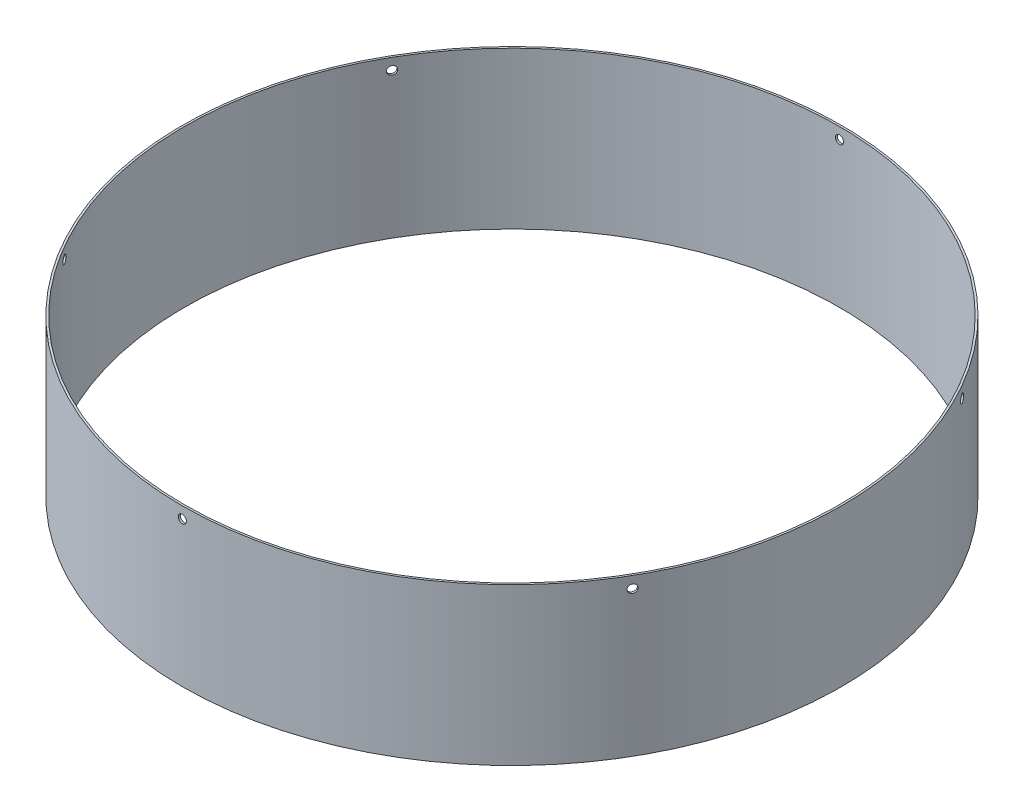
ISO-10303-21;
HEADER;
FILE_DESCRIPTION(('STEP AP214'),'2;1');
FILE_NAME('part.step','',(''),(''),'','','');
FILE_SCHEMA(('AUTOMOTIVE_DESIGN { 1 0 10303 214 1 1 1 1 }'));
ENDSEC;
DATA;
#1=APPLICATION_CONTEXT('core data for automotive mechanical design processes');
#2=APPLICATION_PROTOCOL_DEFINITION('international standard','automotive_design',2000,#1);
#3=PRODUCT_CONTEXT('',#1,'mechanical');
#4=PRODUCT('Part','Part','',(#3));
#5=PRODUCT_RELATED_PRODUCT_CATEGORY('part','',(#4));
#6=PRODUCT_DEFINITION_FORMATION('','',#4);
#7=PRODUCT_DEFINITION_CONTEXT('part definition',#1,'design');
#8=PRODUCT_DEFINITION('design','',#6,#7);
#9=PRODUCT_DEFINITION_SHAPE('','',#8);
#10=(LENGTH_UNIT() NAMED_UNIT(*) SI_UNIT(.MILLI.,.METRE.));
#11=(NAMED_UNIT(*) PLANE_ANGLE_UNIT() SI_UNIT($,.RADIAN.));
#12=(NAMED_UNIT(*) SI_UNIT($,.STERADIAN.) SOLID_ANGLE_UNIT());
#13=UNCERTAINTY_MEASURE_WITH_UNIT(LENGTH_MEASURE(1.E-05),#10,'distance_accuracy_value','');
#14=(GEOMETRIC_REPRESENTATION_CONTEXT(3) GLOBAL_UNCERTAINTY_ASSIGNED_CONTEXT((#13)) GLOBAL_UNIT_ASSIGNED_CONTEXT((#10,
#11,#12)) REPRESENTATION_CONTEXT('',''));
#15=CARTESIAN_POINT('',(0.,0.,0.));
#16=DIRECTION('',(0.,0.,1.));
#17=DIRECTION('',(1.,0.,0.));
#18=AXIS2_PLACEMENT_3D('',#15,#16,#17);
#19=CARTESIAN_POINT('',(0.,69.85,0.));
#20=DIRECTION('',(0.,1.,0.));
#21=DIRECTION('',(0.,0.,1.));
#22=AXIS2_PLACEMENT_3D('',#19,#20,#21);
#23=PLANE('',#22);
#24=CARTESIAN_POINT('',(0.,69.85,0.));
#25=DIRECTION('',(0.,1.,0.));
#26=DIRECTION('',(0.,0.,1.));
#27=AXIS2_PLACEMENT_3D('',#24,#25,#26);
#28=CIRCLE('',#27,146.939);
#29=CARTESIAN_POINT('',(0.,69.85,146.939));
#30=VERTEX_POINT('',#29);
#31=EDGE_CURVE('E10',#30,#30,#28,.T.);
#32=ORIENTED_EDGE('',*,*,#31,.T.);
#33=EDGE_LOOP('',(#32));
#34=FACE_BOUND('',#33,.T.);
#35=CARTESIAN_POINT('',(0.,69.85,0.));
#36=DIRECTION('',(0.,1.,0.));
#37=DIRECTION('',(0.,0.,1.));
#38=AXIS2_PLACEMENT_3D('',#35,#36,#37);
#39=CIRCLE('',#38,146.05);
#40=CARTESIAN_POINT('',(0.,69.85,146.05));
#41=VERTEX_POINT('',#40);
#42=EDGE_CURVE('E50',#41,#41,#39,.T.);
#43=ORIENTED_EDGE('',*,*,#42,.F.);
#44=EDGE_LOOP('',(#43));
#45=FACE_BOUND('',#44,.T.);
#46=ADVANCED_FACE('F32',(#34,#45),#23,.T.);
#47=CARTESIAN_POINT('',(0.,0.,0.));
#48=DIRECTION('',(0.,1.,0.));
#49=DIRECTION('',(0.,0.,1.));
#50=AXIS2_PLACEMENT_3D('',#47,#48,#49);
#51=PLANE('',#50);
#52=CARTESIAN_POINT('',(0.,0.,0.));
#53=DIRECTION('',(0.,1.,0.));
#54=DIRECTION('',(0.,0.,1.));
#55=AXIS2_PLACEMENT_3D('',#52,#53,#54);
#56=CIRCLE('',#55,146.939);
#57=CARTESIAN_POINT('',(0.,0.,146.939));
#58=VERTEX_POINT('',#57);
#59=EDGE_CURVE('E45',#58,#58,#56,.T.);
#60=ORIENTED_EDGE('',*,*,#59,.F.);
#61=EDGE_LOOP('',(#60));
#62=FACE_BOUND('',#61,.T.);
#63=CARTESIAN_POINT('',(0.,0.,0.));
#64=DIRECTION('',(0.,1.,0.));
#65=DIRECTION('',(0.,0.,1.));
#66=AXIS2_PLACEMENT_3D('',#63,#64,#65);
#67=CIRCLE('',#66,146.05);
#68=CARTESIAN_POINT('',(0.,0.,146.05));
#69=VERTEX_POINT('',#68);
#70=EDGE_CURVE('E95',#69,#69,#67,.T.);
#71=ORIENTED_EDGE('',*,*,#70,.T.);
#72=EDGE_LOOP('',(#71));
#73=FACE_BOUND('',#72,.T.);
#74=ADVANCED_FACE('F103',(#62,#73),#51,.F.);
#75=CARTESIAN_POINT('',(0.,69.85,0.));
#76=DIRECTION('',(0.,-1.,0.));
#77=DIRECTION('',(0.,0.,-1.));
#78=AXIS2_PLACEMENT_3D('',#75,#76,#77);
#79=CYLINDRICAL_SURFACE('',#78,146.939);
#80=CARTESIAN_POINT('',(128.157450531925,64.77,-71.8800222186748));
#81=CARTESIAN_POINT('',(128.157448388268,64.8727202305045,-71.8800262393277));
#82=CARTESIAN_POINT('',(128.153203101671,64.9755148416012,-71.8875967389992));
#83=CARTESIAN_POINT('',(128.136319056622,65.1782727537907,-71.9176872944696));
#84=CARTESIAN_POINT('',(128.123670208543,65.278232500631,-71.9402253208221));
#85=CARTESIAN_POINT('',(128.090316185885,65.4723539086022,-71.9995956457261));
#86=CARTESIAN_POINT('',(128.069614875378,65.5665183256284,-72.0364210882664));
#87=CARTESIAN_POINT('',(128.020713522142,65.746392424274,-72.1232909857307));
#88=CARTESIAN_POINT('',(127.99251533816,65.8321041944,-72.1733321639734));
#89=CARTESIAN_POINT('',(127.929369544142,65.9926836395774,-72.2852007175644));
#90=CARTESIAN_POINT('',(127.894420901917,66.067549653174,-72.3470298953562));
#91=CARTESIAN_POINT('',(127.818719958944,66.2042989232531,-72.4806900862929));
#92=CARTESIAN_POINT('',(127.777967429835,66.2661816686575,-72.5525214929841));
#93=CARTESIAN_POINT('',(127.691770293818,66.3752051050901,-72.7041203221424));
#94=CARTESIAN_POINT('',(127.646325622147,66.4223455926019,-72.7838878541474));
#95=CARTESIAN_POINT('',(127.551996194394,66.5005447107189,-72.9490714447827));
#96=CARTESIAN_POINT('',(127.503111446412,66.531603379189,-73.0344874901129));
#97=CARTESIAN_POINT('',(127.403264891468,66.5767558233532,-73.2085232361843));
#98=CARTESIAN_POINT('',(127.352303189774,66.5908504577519,-73.2971427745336));
#99=CARTESIAN_POINT('',(127.24973446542,66.6016773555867,-73.475066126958));
#100=CARTESIAN_POINT('',(127.198127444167,66.5984096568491,-73.5643699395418));
#101=CARTESIAN_POINT('',(127.095738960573,66.5746054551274,-73.7411234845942));
#102=CARTESIAN_POINT('',(127.044957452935,66.5540699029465,-73.8285733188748));
#103=CARTESIAN_POINT('',(126.945676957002,66.4963143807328,-73.9991524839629));
#104=CARTESIAN_POINT('',(126.897177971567,66.4590943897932,-74.0822818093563));
#105=CARTESIAN_POINT('',(126.803869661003,66.3690254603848,-74.2418811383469));
#106=CARTESIAN_POINT('',(126.759060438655,66.3161760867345,-74.3183509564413));
#107=CARTESIAN_POINT('',(126.674446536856,66.1963489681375,-74.4624825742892));
#108=CARTESIAN_POINT('',(126.634641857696,66.1293712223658,-74.5301443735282));
#109=CARTESIAN_POINT('',(126.561210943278,65.9831832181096,-74.6547711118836));
#110=CARTESIAN_POINT('',(126.527585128,65.9039721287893,-74.7117353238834));
#111=CARTESIAN_POINT('',(126.467516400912,65.7355689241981,-74.8133712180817));
#112=CARTESIAN_POINT('',(126.441073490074,65.6463768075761,-74.8580428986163));
#113=CARTESIAN_POINT('',(126.396162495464,65.4605429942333,-74.9338493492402));
#114=CARTESIAN_POINT('',(126.377694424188,65.3639012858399,-74.9649840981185));
#115=CARTESIAN_POINT('',(126.349288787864,65.1659118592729,-75.0128503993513));
#116=CARTESIAN_POINT('',(126.339351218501,65.0645641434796,-75.0295819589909));
#117=CARTESIAN_POINT('',(126.328306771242,64.8600469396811,-75.048176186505));
#118=CARTESIAN_POINT('',(126.327199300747,64.7568775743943,-75.0500398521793));
#119=CARTESIAN_POINT('',(126.333846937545,64.5516393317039,-75.0388491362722));
#120=CARTESIAN_POINT('',(126.341602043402,64.4495704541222,-75.0257947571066));
#121=CARTESIAN_POINT('',(126.365740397,64.2494338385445,-74.9851313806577));
#122=CARTESIAN_POINT('',(126.382123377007,64.1513659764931,-74.9575228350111));
#123=CARTESIAN_POINT('',(126.423024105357,63.9620114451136,-74.8885191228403));
#124=CARTESIAN_POINT('',(126.447541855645,63.8707247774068,-74.84712395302));
#125=CARTESIAN_POINT('',(126.503978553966,63.6975186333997,-74.751696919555));
#126=CARTESIAN_POINT('',(126.535897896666,63.6155996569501,-74.697664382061));
#127=CARTESIAN_POINT('',(126.606185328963,63.463459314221,-74.578470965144));
#128=CARTESIAN_POINT('',(126.64455342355,63.3932379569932,-74.5133100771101));
#129=CARTESIAN_POINT('',(126.726604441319,63.266482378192,-74.373678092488));
#130=CARTESIAN_POINT('',(126.770287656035,63.2099489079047,-74.2992064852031));
#131=CARTESIAN_POINT('',(126.86168383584,63.1121790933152,-74.1430446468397));
#132=CARTESIAN_POINT('',(126.909396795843,63.0709427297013,-74.0613544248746));
#133=CARTESIAN_POINT('',(127.007461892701,63.0049389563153,-73.8930566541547));
#134=CARTESIAN_POINT('',(127.057813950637,62.9801710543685,-73.8064492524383));
#135=CARTESIAN_POINT('',(127.159707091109,62.9478056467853,-73.6307607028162));
#136=CARTESIAN_POINT('',(127.211248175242,62.9402081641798,-73.5416795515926));
#137=CARTESIAN_POINT('',(127.314045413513,62.942399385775,-73.36357497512));
#138=CARTESIAN_POINT('',(127.365301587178,62.9521868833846,-73.2745515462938));
#139=CARTESIAN_POINT('',(127.466086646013,62.988867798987,-73.0990883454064));
#140=CARTESIAN_POINT('',(127.515615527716,63.015761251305,-73.0126485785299));
#141=CARTESIAN_POINT('',(127.611564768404,63.0858910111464,-72.8448186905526));
#142=CARTESIAN_POINT('',(127.657985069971,63.1291276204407,-72.7634286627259));
#143=CARTESIAN_POINT('',(127.746433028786,63.2307144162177,-72.6080338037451));
#144=CARTESIAN_POINT('',(127.788460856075,63.2890640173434,-72.5340286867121));
#145=CARTESIAN_POINT('',(127.866976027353,63.4192181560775,-72.3955282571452));
#146=CARTESIAN_POINT('',(127.903463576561,63.4910221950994,-72.3310325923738));
#147=CARTESIAN_POINT('',(127.969920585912,63.6460720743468,-72.2133902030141));
#148=CARTESIAN_POINT('',(127.999888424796,63.7293207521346,-72.1602463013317));
#149=CARTESIAN_POINT('',(128.052501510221,63.9049143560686,-72.0668402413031));
#150=CARTESIAN_POINT('',(128.075143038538,63.9972638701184,-72.0265846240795));
#151=CARTESIAN_POINT('',(128.112457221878,64.1883340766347,-71.9601937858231));
#152=CARTESIAN_POINT('',(128.12713942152,64.2870469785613,-71.934041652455));
#153=CARTESIAN_POINT('',(128.144235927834,64.4503233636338,-71.9035790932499));
#154=CARTESIAN_POINT('',(128.149185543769,64.5138261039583,-71.8947564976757));
#155=CARTESIAN_POINT('',(128.155793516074,64.6415428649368,-71.8829768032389));
#156=CARTESIAN_POINT('',(128.157451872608,64.7057568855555,-71.8800197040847));
#157=CARTESIAN_POINT('',(128.157450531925,64.77,-71.8800222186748));
#158=B_SPLINE_CURVE_WITH_KNOTS('',3,(#80,#81,#82,#83,#84,#85,#86,#87,#88,#89,#90,#91,#92,#93,
#94,#95,#96,#97,#98,#99,#100,#101,#102,#103,#104,#105,#106,#107,#108,#109,#110,#111,#112,#113,
#114,#115,#116,#117,#118,#119,#120,#121,#122,#123,#124,#125,#126,#127,#128,#129,#130,#131,#132,
#133,#134,#135,#136,#137,#138,#139,#140,#141,#142,#143,#144,#145,#146,#147,#148,#149,#150,#151,
#152,#153,#154,#155,#156,#157),.UNSPECIFIED.,.T.,.F.,(4,2,2,2,2,2,2,2,2,2,2,2,2,2,2,2,2,2,2,2,2,
2,2,2,2,2,2,2,2,2,2,2,2,2,2,2,2,2,4),(0.,0.307926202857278,0.616222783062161,0.924371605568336,
1.23244409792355,1.54056373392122,1.8486954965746,2.15683151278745,2.46496680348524,
2.77308649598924,3.08120551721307,3.38930757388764,3.69741001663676,4.00552103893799,
4.31363207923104,4.62176405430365,4.92989607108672,5.23802857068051,5.54616091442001,
5.85427257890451,6.16238419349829,6.470486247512,6.77858837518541,7.08670693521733,
7.39482573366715,7.70296143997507,8.01109675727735,8.31922286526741,8.6273493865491,
8.93545452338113,9.24356027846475,9.55167172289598,9.85977123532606,10.1678593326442,
10.4760239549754,10.7843447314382,11.092294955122,11.2848776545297,11.4774603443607),.UNSPECIFIED.);
#159=CARTESIAN_POINT('',(128.157450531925,64.77,-71.8800222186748));
#160=VERTEX_POINT('',#159);
#161=EDGE_CURVE('E61',#160,#160,#158,.T.);
#162=ORIENTED_EDGE('',*,*,#161,.T.);
#163=EDGE_LOOP('',(#162));
#164=FACE_BOUND('',#163,.T.);
#165=CARTESIAN_POINT('',(126.328650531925,64.77,75.0475967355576));
#166=CARTESIAN_POINT('',(126.328652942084,64.8727202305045,75.0475928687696));
#167=CARTESIAN_POINT('',(126.33308654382,64.9755148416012,75.0401310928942));
#168=CARTESIAN_POINT('',(126.350703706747,65.1782727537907,75.0104638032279));
#169=CARTESIAN_POINT('',(126.36389778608,65.278232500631,74.9882405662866));
#170=CARTESIAN_POINT('',(126.398636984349,65.4723539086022,74.9296699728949));
#171=CARTESIAN_POINT('',(126.420178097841,65.5665183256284,74.893329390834));
#172=CARTESIAN_POINT('',(126.470958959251,65.746392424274,74.8075446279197));
#173=CARTESIAN_POINT('',(126.500196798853,65.8321041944,74.7581036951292));
#174=CARTESIAN_POINT('',(126.565504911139,65.9926836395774,74.6474835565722));
#175=CARTESIAN_POINT('',(126.601576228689,66.0675496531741,74.5863025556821));
#176=CARTESIAN_POINT('',(126.679478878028,66.2042989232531,74.4539135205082));
#177=CARTESIAN_POINT('',(126.721310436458,66.2661816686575,74.3827050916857));
#178=CARTESIAN_POINT('',(126.809500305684,66.3752051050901,74.2322567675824));
#179=CARTESIAN_POINT('',(126.855858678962,66.422345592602,74.1530167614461));
#180=CARTESIAN_POINT('',(126.951747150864,66.5005447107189,73.9887332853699));
#181=CARTESIAN_POINT('',(127.00127724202,66.531603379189,73.903689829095));
#182=CARTESIAN_POINT('',(127.102073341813,66.5767558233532,73.7302023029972));
#183=CARTESIAN_POINT('',(127.153339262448,66.5908504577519,73.6417584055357));
#184=CARTESIAN_POINT('',(127.256141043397,66.6016773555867,73.4639696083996));
#185=CARTESIAN_POINT('',(127.307676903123,66.5984096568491,73.3746247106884));
#186=CARTESIAN_POINT('',(127.40955572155,66.5746054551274,73.1975769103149));
#187=CARTESIAN_POINT('',(127.459898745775,66.5540699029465,73.1098739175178));
#188=CARTESIAN_POINT('',(127.557984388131,66.4963143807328,72.9386049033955));
#189=CARTESIAN_POINT('',(127.605727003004,66.4590943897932,72.8550388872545));
#190=CARTESIAN_POINT('',(127.697289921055,66.3690254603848,72.6944318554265));
#191=CARTESIAN_POINT('',(127.741110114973,66.3161760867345,72.6173910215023));
#192=CARTESIAN_POINT('',(127.823624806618,66.1963489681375,72.4720474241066));
#193=CARTESIAN_POINT('',(127.862319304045,66.1293712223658,72.4037446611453));
#194=CARTESIAN_POINT('',(127.933533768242,65.9831832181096,72.2778382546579));
#195=CARTESIAN_POINT('',(127.966053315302,65.9039721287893,72.220235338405));
#196=CARTESIAN_POINT('',(128.02403821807,65.7355689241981,72.1173963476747));
#197=CARTESIAN_POINT('',(128.049503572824,65.6463768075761,72.0721602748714));
#198=CARTESIAN_POINT('',(128.09269838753,65.4605429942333,71.9953629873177));
#199=CARTESIAN_POINT('',(128.110427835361,65.3639012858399,71.9638017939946));
#200=CARTESIAN_POINT('',(128.137678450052,65.1659118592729,71.9152686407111));
#201=CARTESIAN_POINT('',(128.147199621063,65.0645641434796,71.8982966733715));
#202=CARTESIAN_POINT('',(128.157780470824,64.8600469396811,71.8794347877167));
#203=CARTESIAN_POINT('',(128.158840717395,64.7568775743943,71.8775438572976));
#204=CARTESIAN_POINT('',(128.152473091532,64.5516393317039,71.888896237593));
#205=CARTESIAN_POINT('',(128.145045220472,64.4495704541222,71.9021395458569));
#206=CARTESIAN_POINT('',(128.121898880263,64.2494338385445,71.9433756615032));
#207=CARTESIAN_POINT('',(128.106180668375,64.1513659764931,71.9713680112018));
#208=CARTESIAN_POINT('',(128.066872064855,63.9620114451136,72.0412909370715));
#209=CARTESIAN_POINT('',(128.04328167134,63.8707247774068,72.0832215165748));
#210=CARTESIAN_POINT('',(127.988857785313,63.6975186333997,72.1798106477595));
#211=CARTESIAN_POINT('',(127.958023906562,63.6155996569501,72.2344698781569));
#212=CARTESIAN_POINT('',(127.889943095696,63.463459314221,72.3549372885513));
#213=CARTESIAN_POINT('',(127.852696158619,63.3932379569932,72.4207454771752));
#214=CARTESIAN_POINT('',(127.77279682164,63.266482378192,72.5616197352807));
#215=CARTESIAN_POINT('',(127.730144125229,63.2099489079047,72.6366863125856));
#216=CARTESIAN_POINT('',(127.640602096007,63.1121790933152,72.7939186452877));
#217=CARTESIAN_POINT('',(127.593712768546,63.0709427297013,72.8760843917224));
#218=CARTESIAN_POINT('',(127.496995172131,63.0049389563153,73.0451601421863));
#219=CARTESIAN_POINT('',(127.447166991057,62.9801710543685,73.1320700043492));
#220=CARTESIAN_POINT('',(127.345962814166,62.9478056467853,73.3081563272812));
#221=CARTESIAN_POINT('',(127.294586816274,62.9402081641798,73.3973327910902));
#222=CARTESIAN_POINT('',(127.191742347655,62.942399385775,73.5754100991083));
#223=CARTESIAN_POINT('',(127.140273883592,62.9521868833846,73.6643109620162));
#224=CARTESIAN_POINT('',(127.038710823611,62.988867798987,73.8393249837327));
#225=CARTESIAN_POINT('',(126.98861623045,63.015761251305,73.9254381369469));
#226=CARTESIAN_POINT('',(126.891245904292,63.0858910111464,74.0924475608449));
#227=CARTESIAN_POINT('',(126.843970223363,63.1291276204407,74.1733437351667));
#228=CARTESIAN_POINT('',(126.753618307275,63.2307144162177,74.3276393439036));
#229=CARTESIAN_POINT('',(126.710541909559,63.2890640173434,74.4010390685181));
#230=CARTESIAN_POINT('',(126.629854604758,63.4192181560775,74.5382854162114));
#231=CARTESIAN_POINT('',(126.592243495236,63.4910221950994,74.6021323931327));
#232=CARTESIAN_POINT('',(126.523590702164,63.6460720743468,74.7185070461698));
#233=CARTESIAN_POINT('',(126.492550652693,63.7293207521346,74.7710319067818));
#234=CARTESIAN_POINT('',(126.437965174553,63.9049143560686,74.8632992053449));
#235=CARTESIAN_POINT('',(126.414423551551,63.9972638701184,74.9030351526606));
#236=CARTESIAN_POINT('',(126.375584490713,64.1883340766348,74.9685456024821));
#237=CARTESIAN_POINT('',(126.360277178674,64.2870469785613,74.9943368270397));
#238=CARTESIAN_POINT('',(126.342444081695,64.4503233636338,75.0243741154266));
#239=CARTESIAN_POINT('',(126.337278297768,64.5138261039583,75.0330719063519));
#240=CARTESIAN_POINT('',(126.330380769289,64.6415428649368,75.0446844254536));
#241=CARTESIAN_POINT('',(126.328649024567,64.7057568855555,75.0475991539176));
#242=CARTESIAN_POINT('',(126.328650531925,64.77,75.0475967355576));
#243=B_SPLINE_CURVE_WITH_KNOTS('',3,(#165,#166,#167,#168,#169,#170,#171,#172,#173,#174,#175,
#176,#177,#178,#179,#180,#181,#182,#183,#184,#185,#186,#187,#188,#189,#190,#191,#192,#193,#194,
#195,#196,#197,#198,#199,#200,#201,#202,#203,#204,#205,#206,#207,#208,#209,#210,#211,#212,#213,
#214,#215,#216,#217,#218,#219,#220,#221,#222,#223,#224,#225,#226,#227,#228,#229,#230,#231,#232,
#233,#234,#235,#236,#237,#238,#239,#240,#241,#242),.UNSPECIFIED.,.T.,.F.,(4,2,2,2,2,2,2,2,2,2,2,
2,2,2,2,2,2,2,2,2,2,2,2,2,2,2,2,2,2,2,2,2,2,2,2,2,2,2,4),(0.,0.307926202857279,0.61622278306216,
0.924371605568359,1.23244409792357,1.54056373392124,1.84869549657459,2.15683151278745,
2.46496680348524,2.77308649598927,3.08120551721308,3.38930757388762,3.69741001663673,
4.005521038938,4.31363207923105,4.62176405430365,4.92989607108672,5.23802857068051,
5.54616091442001,5.85427257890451,6.16238419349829,6.47048624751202,6.77858837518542,
7.08670693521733,7.39482573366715,7.70296143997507,8.01109675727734,8.3192228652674,
8.62734938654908,8.93545452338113,9.24356027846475,9.55167172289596,9.85977123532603,
10.1678593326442,10.4760239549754,10.7843447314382,11.092294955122,11.2848776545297,
11.4774603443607),.UNSPECIFIED.);
#244=CARTESIAN_POINT('',(126.328650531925,64.77,75.0475967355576));
#245=VERTEX_POINT('',#244);
#246=EDGE_CURVE('E174',#245,#245,#243,.T.);
#247=ORIENTED_EDGE('',*,*,#246,.T.);
#248=EDGE_LOOP('',(#247));
#249=FACE_BOUND('',#248,.T.);
#250=CARTESIAN_POINT('',(-126.328650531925,64.77,75.0475967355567));
#251=CARTESIAN_POINT('',(-126.328652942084,64.6672797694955,75.0475928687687));
#252=CARTESIAN_POINT('',(-126.33308654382,64.5644851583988,75.0401310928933));
#253=CARTESIAN_POINT('',(-126.350703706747,64.3617272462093,75.010463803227));
#254=CARTESIAN_POINT('',(-126.36389778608,64.261767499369,74.9882405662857));
#255=CARTESIAN_POINT('',(-126.398636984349,64.0676460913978,74.929669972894));
#256=CARTESIAN_POINT('',(-126.420178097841,63.9734816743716,74.8933293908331));
#257=CARTESIAN_POINT('',(-126.470958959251,63.793607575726,74.8075446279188));
#258=CARTESIAN_POINT('',(-126.500196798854,63.7078958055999,74.7581036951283));
#259=CARTESIAN_POINT('',(-126.565504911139,63.5473163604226,74.6474835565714));
#260=CARTESIAN_POINT('',(-126.60157622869,63.4724503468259,74.5863025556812));
#261=CARTESIAN_POINT('',(-126.679478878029,63.3357010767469,74.4539135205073));
#262=CARTESIAN_POINT('',(-126.721310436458,63.2738183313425,74.3827050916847));
#263=CARTESIAN_POINT('',(-126.809500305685,63.1647948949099,74.2322567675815));
#264=CARTESIAN_POINT('',(-126.855858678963,63.117654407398,74.1530167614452));
#265=CARTESIAN_POINT('',(-126.951747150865,63.0394552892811,73.9887332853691));
#266=CARTESIAN_POINT('',(-127.001277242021,63.008396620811,73.9036898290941));
#267=CARTESIAN_POINT('',(-127.102073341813,62.9632441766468,73.7302023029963));
#268=CARTESIAN_POINT('',(-127.153339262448,62.9491495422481,73.6417584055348));
#269=CARTESIAN_POINT('',(-127.256141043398,62.9383226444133,73.4639696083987));
#270=CARTESIAN_POINT('',(-127.307676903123,62.9415903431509,73.3746247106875));
#271=CARTESIAN_POINT('',(-127.409555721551,62.9653945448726,73.197576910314));
#272=CARTESIAN_POINT('',(-127.459898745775,62.9859300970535,73.1098739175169));
#273=CARTESIAN_POINT('',(-127.557984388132,63.0436856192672,72.9386049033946));
#274=CARTESIAN_POINT('',(-127.605727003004,63.0809056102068,72.8550388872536));
#275=CARTESIAN_POINT('',(-127.697289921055,63.1709745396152,72.6944318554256));
#276=CARTESIAN_POINT('',(-127.741110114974,63.2238239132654,72.6173910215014));
#277=CARTESIAN_POINT('',(-127.823624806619,63.3436510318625,72.4720474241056));
#278=CARTESIAN_POINT('',(-127.862319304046,63.4106287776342,72.4037446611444));
#279=CARTESIAN_POINT('',(-127.933533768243,63.5568167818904,72.277838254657));
#280=CARTESIAN_POINT('',(-127.966053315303,63.6360278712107,72.220235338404));
#281=CARTESIAN_POINT('',(-128.024038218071,63.8044310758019,72.1173963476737));
#282=CARTESIAN_POINT('',(-128.049503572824,63.8936231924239,72.0721602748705));
#283=CARTESIAN_POINT('',(-128.09269838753,64.0794570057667,71.9953629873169));
#284=CARTESIAN_POINT('',(-128.110427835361,64.17609871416,71.9638017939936));
#285=CARTESIAN_POINT('',(-128.137678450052,64.3740881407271,71.9152686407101));
#286=CARTESIAN_POINT('',(-128.147199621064,64.4754358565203,71.8982966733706));
#287=CARTESIAN_POINT('',(-128.157780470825,64.6799530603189,71.8794347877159));
#288=CARTESIAN_POINT('',(-128.158840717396,64.7831224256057,71.8775438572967));
#289=CARTESIAN_POINT('',(-128.152473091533,64.9883606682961,71.8888962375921));
#290=CARTESIAN_POINT('',(-128.145045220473,65.0904295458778,71.9021395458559));
#291=CARTESIAN_POINT('',(-128.121898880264,65.2905661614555,71.9433756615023));
#292=CARTESIAN_POINT('',(-128.106180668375,65.3886340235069,71.9713680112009));
#293=CARTESIAN_POINT('',(-128.066872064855,65.5779885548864,72.0412909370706));
#294=CARTESIAN_POINT('',(-128.043281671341,65.6692752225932,72.083221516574));
#295=CARTESIAN_POINT('',(-127.988857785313,65.8424813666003,72.1798106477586));
#296=CARTESIAN_POINT('',(-127.958023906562,65.9244003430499,72.234469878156));
#297=CARTESIAN_POINT('',(-127.889943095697,66.076540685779,72.3549372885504));
#298=CARTESIAN_POINT('',(-127.85269615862,66.1467620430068,72.4207454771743));
#299=CARTESIAN_POINT('',(-127.772796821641,66.273517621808,72.5616197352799));
#300=CARTESIAN_POINT('',(-127.730144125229,66.3300510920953,72.6366863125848));
#301=CARTESIAN_POINT('',(-127.640602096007,66.4278209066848,72.7939186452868));
#302=CARTESIAN_POINT('',(-127.593712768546,66.4690572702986,72.8760843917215));
#303=CARTESIAN_POINT('',(-127.496995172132,66.5350610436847,73.0451601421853));
#304=CARTESIAN_POINT('',(-127.447166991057,66.5598289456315,73.1320700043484));
#305=CARTESIAN_POINT('',(-127.345962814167,66.5921943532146,73.3081563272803));
#306=CARTESIAN_POINT('',(-127.294586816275,66.5997918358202,73.3973327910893));
#307=CARTESIAN_POINT('',(-127.191742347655,66.597600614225,73.5754100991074));
#308=CARTESIAN_POINT('',(-127.140273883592,66.5878131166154,73.6643109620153));
#309=CARTESIAN_POINT('',(-127.038710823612,66.551132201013,73.8393249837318));
#310=CARTESIAN_POINT('',(-126.988616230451,66.524238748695,73.925438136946));
#311=CARTESIAN_POINT('',(-126.891245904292,66.4541089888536,74.0924475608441));
#312=CARTESIAN_POINT('',(-126.843970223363,66.4108723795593,74.1733437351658));
#313=CARTESIAN_POINT('',(-126.753618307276,66.3092855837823,74.3276393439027));
#314=CARTESIAN_POINT('',(-126.71054190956,66.2509359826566,74.4010390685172));
#315=CARTESIAN_POINT('',(-126.629854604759,66.1207818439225,74.5382854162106));
#316=CARTESIAN_POINT('',(-126.592243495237,66.0489778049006,74.6021323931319));
#317=CARTESIAN_POINT('',(-126.523590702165,65.8939279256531,74.718507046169));
#318=CARTESIAN_POINT('',(-126.492550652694,65.8106792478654,74.7710319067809));
#319=CARTESIAN_POINT('',(-126.437965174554,65.6350856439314,74.863299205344));
#320=CARTESIAN_POINT('',(-126.414423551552,65.5427361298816,74.9030351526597));
#321=CARTESIAN_POINT('',(-126.375584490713,65.3516659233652,74.9685456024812));
#322=CARTESIAN_POINT('',(-126.360277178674,65.2529530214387,74.9943368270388));
#323=CARTESIAN_POINT('',(-126.342444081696,65.0896766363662,75.0243741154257));
#324=CARTESIAN_POINT('',(-126.337278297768,65.0261738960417,75.033071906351));
#325=CARTESIAN_POINT('',(-126.33038076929,64.8984571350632,75.0446844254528));
#326=CARTESIAN_POINT('',(-126.328649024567,64.8342431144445,75.0475991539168));
#327=CARTESIAN_POINT('',(-126.328650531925,64.77,75.0475967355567));
#328=B_SPLINE_CURVE_WITH_KNOTS('',3,(#250,#251,#252,#253,#254,#255,#256,#257,#258,#259,#260,
#261,#262,#263,#264,#265,#266,#267,#268,#269,#270,#271,#272,#273,#274,#275,#276,#277,#278,#279,
#280,#281,#282,#283,#284,#285,#286,#287,#288,#289,#290,#291,#292,#293,#294,#295,#296,#297,#298,
#299,#300,#301,#302,#303,#304,#305,#306,#307,#308,#309,#310,#311,#312,#313,#314,#315,#316,#317,
#318,#319,#320,#321,#322,#323,#324,#325,#326,#327),.UNSPECIFIED.,.T.,.F.,(4,2,2,2,2,2,2,2,2,2,2,
2,2,2,2,2,2,2,2,2,2,2,2,2,2,2,2,2,2,2,2,2,2,2,2,2,2,2,4),(0.,0.307926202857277,0.61622278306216,
0.924371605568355,1.23244409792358,1.54056373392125,1.84869549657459,2.15683151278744,
2.46496680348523,2.77308649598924,3.08120551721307,3.38930757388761,3.69741001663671,
4.00552103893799,4.31363207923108,4.62176405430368,4.92989607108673,5.23802857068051,
5.54616091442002,5.85427257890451,6.1623841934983,6.47048624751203,6.77858837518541,
7.08670693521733,7.39482573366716,7.70296143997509,8.01109675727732,8.31922286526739,
8.62734938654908,8.93545452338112,9.24356027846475,9.55167172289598,9.85977123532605,
10.1678593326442,10.4760239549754,10.7843447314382,11.092294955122,11.2848776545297,
11.4774603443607),.UNSPECIFIED.);
#329=CARTESIAN_POINT('',(-126.328650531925,64.77,75.0475967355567));
#330=VERTEX_POINT('',#329);
#331=EDGE_CURVE('E170',#330,#330,#328,.T.);
#332=ORIENTED_EDGE('',*,*,#331,.T.);
#333=EDGE_LOOP('',(#332));
#334=FACE_BOUND('',#333,.T.);
#335=CARTESIAN_POINT('',(-128.157450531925,64.77,-71.8800222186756));
#336=CARTESIAN_POINT('',(-128.157448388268,64.6672797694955,-71.8800262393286));
#337=CARTESIAN_POINT('',(-128.15320310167,64.5644851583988,-71.8875967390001));
#338=CARTESIAN_POINT('',(-128.136319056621,64.3617272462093,-71.9176872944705));
#339=CARTESIAN_POINT('',(-128.123670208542,64.261767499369,-71.940225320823));
#340=CARTESIAN_POINT('',(-128.090316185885,64.0676460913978,-71.9995956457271));
#341=CARTESIAN_POINT('',(-128.069614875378,63.9734816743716,-72.0364210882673));
#342=CARTESIAN_POINT('',(-128.020713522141,63.793607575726,-72.1232909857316));
#343=CARTESIAN_POINT('',(-127.992515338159,63.7078958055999,-72.1733321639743));
#344=CARTESIAN_POINT('',(-127.929369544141,63.5473163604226,-72.2852007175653));
#345=CARTESIAN_POINT('',(-127.894420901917,63.472450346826,-72.3470298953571));
#346=CARTESIAN_POINT('',(-127.818719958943,63.3357010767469,-72.4806900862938));
#347=CARTESIAN_POINT('',(-127.777967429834,63.2738183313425,-72.552521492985));
#348=CARTESIAN_POINT('',(-127.691770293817,63.1647948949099,-72.7041203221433));
#349=CARTESIAN_POINT('',(-127.646325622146,63.117654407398,-72.7838878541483));
#350=CARTESIAN_POINT('',(-127.551996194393,63.0394552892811,-72.9490714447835));
#351=CARTESIAN_POINT('',(-127.503111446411,63.008396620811,-73.0344874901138));
#352=CARTESIAN_POINT('',(-127.403264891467,62.9632441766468,-73.2085232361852));
#353=CARTESIAN_POINT('',(-127.352303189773,62.9491495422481,-73.2971427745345));
#354=CARTESIAN_POINT('',(-127.24973446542,62.9383226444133,-73.4750661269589));
#355=CARTESIAN_POINT('',(-127.198127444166,62.9415903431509,-73.5643699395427));
#356=CARTESIAN_POINT('',(-127.095738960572,62.9653945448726,-73.7411234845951));
#357=CARTESIAN_POINT('',(-127.044957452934,62.9859300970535,-73.8285733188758));
#358=CARTESIAN_POINT('',(-126.945676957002,63.0436856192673,-73.9991524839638));
#359=CARTESIAN_POINT('',(-126.897177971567,63.0809056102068,-74.0822818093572));
#360=CARTESIAN_POINT('',(-126.803869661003,63.1709745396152,-74.2418811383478));
#361=CARTESIAN_POINT('',(-126.759060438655,63.2238239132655,-74.3183509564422));
#362=CARTESIAN_POINT('',(-126.674446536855,63.3436510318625,-74.4624825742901));
#363=CARTESIAN_POINT('',(-126.634641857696,63.4106287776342,-74.5301443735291));
#364=CARTESIAN_POINT('',(-126.561210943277,63.5568167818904,-74.6547711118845));
#365=CARTESIAN_POINT('',(-126.527585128,63.6360278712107,-74.7117353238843));
#366=CARTESIAN_POINT('',(-126.467516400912,63.8044310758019,-74.8133712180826));
#367=CARTESIAN_POINT('',(-126.441073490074,63.8936231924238,-74.8580428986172));
#368=CARTESIAN_POINT('',(-126.396162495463,64.0794570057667,-74.9338493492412));
#369=CARTESIAN_POINT('',(-126.377694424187,64.17609871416,-74.9649840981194));
#370=CARTESIAN_POINT('',(-126.349288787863,64.3740881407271,-75.0128503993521));
#371=CARTESIAN_POINT('',(-126.339351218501,64.4754358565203,-75.0295819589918));
#372=CARTESIAN_POINT('',(-126.328306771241,64.6799530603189,-75.0481761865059));
#373=CARTESIAN_POINT('',(-126.327199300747,64.7831224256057,-75.0500398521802));
#374=CARTESIAN_POINT('',(-126.333846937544,64.988360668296,-75.0388491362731));
#375=CARTESIAN_POINT('',(-126.341602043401,65.0904295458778,-75.0257947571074));
#376=CARTESIAN_POINT('',(-126.365740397,65.2905661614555,-74.9851313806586));
#377=CARTESIAN_POINT('',(-126.382123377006,65.3886340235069,-74.957522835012));
#378=CARTESIAN_POINT('',(-126.423024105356,65.5779885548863,-74.8885191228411));
#379=CARTESIAN_POINT('',(-126.447541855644,65.6692752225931,-74.8471239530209));
#380=CARTESIAN_POINT('',(-126.503978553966,65.8424813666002,-74.7516969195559));
#381=CARTESIAN_POINT('',(-126.535897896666,65.9244003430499,-74.6976643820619));
#382=CARTESIAN_POINT('',(-126.606185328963,66.076540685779,-74.5784709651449));
#383=CARTESIAN_POINT('',(-126.64455342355,66.1467620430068,-74.513310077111));
#384=CARTESIAN_POINT('',(-126.726604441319,66.273517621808,-74.3736780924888));
#385=CARTESIAN_POINT('',(-126.770287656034,66.3300510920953,-74.2992064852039));
#386=CARTESIAN_POINT('',(-126.86168383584,66.4278209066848,-74.1430446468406));
#387=CARTESIAN_POINT('',(-126.909396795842,66.4690572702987,-74.0613544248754));
#388=CARTESIAN_POINT('',(-127.007461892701,66.5350610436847,-73.8930566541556));
#389=CARTESIAN_POINT('',(-127.057813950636,66.5598289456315,-73.8064492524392));
#390=CARTESIAN_POINT('',(-127.159707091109,66.5921943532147,-73.6307607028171));
#391=CARTESIAN_POINT('',(-127.211248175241,66.5997918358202,-73.5416795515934));
#392=CARTESIAN_POINT('',(-127.314045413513,66.597600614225,-73.3635749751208));
#393=CARTESIAN_POINT('',(-127.365301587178,66.5878131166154,-73.2745515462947));
#394=CARTESIAN_POINT('',(-127.466086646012,66.551132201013,-73.0990883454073));
#395=CARTESIAN_POINT('',(-127.515615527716,66.524238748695,-73.0126485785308));
#396=CARTESIAN_POINT('',(-127.611564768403,66.4541089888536,-72.8448186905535));
#397=CARTESIAN_POINT('',(-127.65798506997,66.4108723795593,-72.7634286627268));
#398=CARTESIAN_POINT('',(-127.746433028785,66.3092855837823,-72.608033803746));
#399=CARTESIAN_POINT('',(-127.788460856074,66.2509359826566,-72.534028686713));
#400=CARTESIAN_POINT('',(-127.866976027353,66.1207818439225,-72.3955282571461));
#401=CARTESIAN_POINT('',(-127.90346357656,66.0489778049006,-72.3310325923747));
#402=CARTESIAN_POINT('',(-127.969920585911,65.8939279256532,-72.2133902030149));
#403=CARTESIAN_POINT('',(-127.999888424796,65.8106792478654,-72.1602463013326));
#404=CARTESIAN_POINT('',(-128.05250151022,65.6350856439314,-72.066840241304));
#405=CARTESIAN_POINT('',(-128.075143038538,65.5427361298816,-72.0265846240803));
#406=CARTESIAN_POINT('',(-128.112457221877,65.3516659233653,-71.960193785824));
#407=CARTESIAN_POINT('',(-128.127139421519,65.2529530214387,-71.9340416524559));
#408=CARTESIAN_POINT('',(-128.144235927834,65.0896766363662,-71.9035790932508));
#409=CARTESIAN_POINT('',(-128.149185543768,65.0261738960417,-71.8947564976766));
#410=CARTESIAN_POINT('',(-128.155793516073,64.8984571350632,-71.8829768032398));
#411=CARTESIAN_POINT('',(-128.157451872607,64.8342431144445,-71.8800197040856));
#412=CARTESIAN_POINT('',(-128.157450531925,64.77,-71.8800222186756));
#413=B_SPLINE_CURVE_WITH_KNOTS('',3,(#335,#336,#337,#338,#339,#340,#341,#342,#343,#344,#345,
#346,#347,#348,#349,#350,#351,#352,#353,#354,#355,#356,#357,#358,#359,#360,#361,#362,#363,#364,
#365,#366,#367,#368,#369,#370,#371,#372,#373,#374,#375,#376,#377,#378,#379,#380,#381,#382,#383,
#384,#385,#386,#387,#388,#389,#390,#391,#392,#393,#394,#395,#396,#397,#398,#399,#400,#401,#402,
#403,#404,#405,#406,#407,#408,#409,#410,#411,#412),.UNSPECIFIED.,.T.,.F.,(4,2,2,2,2,2,2,2,2,2,2,
2,2,2,2,2,2,2,2,2,2,2,2,2,2,2,2,2,2,2,2,2,2,2,2,2,2,2,4),(0.,0.307926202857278,
0.616222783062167,0.924371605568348,1.23244409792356,1.54056373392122,1.8486954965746,
2.15683151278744,2.46496680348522,2.77308649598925,3.08120551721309,3.38930757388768,
3.69741001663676,4.005521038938,4.31363207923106,4.62176405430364,4.92989607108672,
5.23802857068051,5.54616091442,5.85427257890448,6.16238419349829,6.47048624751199,
6.77858837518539,7.08670693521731,7.39482573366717,7.70296143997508,8.01109675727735,
8.31922286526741,8.62734938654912,8.93545452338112,9.24356027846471,9.55167172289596,
9.85977123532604,10.1678593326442,10.4760239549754,10.7843447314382,11.092294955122,
11.2848776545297,11.4774603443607),.UNSPECIFIED.);
#414=CARTESIAN_POINT('',(-128.157450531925,64.77,-71.8800222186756));
#415=VERTEX_POINT('',#414);
#416=EDGE_CURVE('E149',#415,#415,#413,.T.);
#417=ORIENTED_EDGE('',*,*,#416,.T.);
#418=EDGE_LOOP('',(#417));
#419=FACE_BOUND('',#418,.T.);
#420=CARTESIAN_POINT('',(0.,66.5988,-146.939));
#421=CARTESIAN_POINT('',(-0.102720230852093,66.5987954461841,-146.938999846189));
#422=CARTESIAN_POINT('',(-0.205514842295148,66.5901165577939,-146.938891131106));
#423=CARTESIAN_POINT('',(-0.408272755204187,66.5556153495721,-146.938467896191));
#424=CARTESIAN_POINT('',(-0.508232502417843,66.5297724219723,-146.938153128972));
#425=CARTESIAN_POINT('',(-0.702353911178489,66.4616792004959,-146.937353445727));
#426=CARTESIAN_POINT('',(-0.796518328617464,66.4194367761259,-146.93686861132));
#427=CARTESIAN_POINT('',(-0.976392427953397,66.3197545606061,-146.935783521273));
#428=CARTESIAN_POINT('',(-1.0621041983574,66.2623185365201,-146.935183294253));
#429=CARTESIAN_POINT('',(-1.22268364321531,66.1338646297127,-146.933934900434));
#430=CARTESIAN_POINT('',(-1.2975496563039,66.0628446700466,-146.933286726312));
#431=CARTESIAN_POINT('',(-1.43429892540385,65.9092410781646,-146.932015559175));
#432=CARTESIAN_POINT('',(-1.4961816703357,65.8266569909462,-146.931392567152));
#433=CARTESIAN_POINT('',(-1.60520510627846,65.6522699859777,-146.930242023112));
#434=CARTESIAN_POINT('',(-1.65234559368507,65.5604669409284,-146.929714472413));
#435=CARTESIAN_POINT('',(-1.7305447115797,65.3702490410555,-146.92881430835));
#436=CARTESIAN_POINT('',(-1.76160337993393,65.2718342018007,-146.928441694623));
#437=CARTESIAN_POINT('',(-1.80675582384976,65.0711915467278,-146.927893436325));
#438=CARTESIAN_POINT('',(-1.82085045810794,64.9689639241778,-146.927717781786));
#439=CARTESIAN_POINT('',(-1.83167735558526,64.7635934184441,-146.927583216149));
#440=CARTESIAN_POINT('',(-1.82840965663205,64.6604505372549,-146.927624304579));
#441=CARTESIAN_POINT('',(-1.80460545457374,64.4561832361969,-146.927918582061));
#442=CARTESIAN_POINT('',(-1.78406990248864,64.3550587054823,-146.928171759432));
#443=CARTESIAN_POINT('',(-1.72631438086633,64.1576925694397,-146.928861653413));
#444=CARTESIAN_POINT('',(-1.68909439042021,64.0614509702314,-146.929298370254));
#445=CARTESIAN_POINT('',(-1.59902546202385,63.8765797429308,-146.930306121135));
#446=CARTESIAN_POINT('',(-1.54617608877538,63.7879503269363,-146.930877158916));
#447=CARTESIAN_POINT('',(-1.42634897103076,63.6208217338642,-146.932089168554));
#448=CARTESIAN_POINT('',(-1.35937122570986,63.5423225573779,-146.932730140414));
#449=CARTESIAN_POINT('',(-1.21318322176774,63.3976771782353,-146.934009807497));
#450=CARTESIAN_POINT('',(-1.13397213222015,63.3315318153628,-146.934648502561));
#451=CARTESIAN_POINT('',(-0.965568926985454,63.2134781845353,-146.935851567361));
#452=CARTESIAN_POINT('',(-0.876376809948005,63.1615699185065,-146.936415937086));
#453=CARTESIAN_POINT('',(-0.690542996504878,63.0734641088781,-146.937406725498));
#454=CARTESIAN_POINT('',(-0.593901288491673,63.0372665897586,-146.937833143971));
#455=CARTESIAN_POINT('',(-0.395911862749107,62.9816103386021,-146.938499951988));
#456=CARTESIAN_POINT('',(-0.294564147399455,62.9621515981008,-146.938740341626));
#457=CARTESIAN_POINT('',(-0.0900469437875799,62.9405263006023,-146.939007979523));
#458=CARTESIAN_POINT('',(0.0131224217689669,62.938358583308,-146.939035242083));
#459=CARTESIAN_POINT('',(0.218360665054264,62.951373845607,-146.938873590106));
#460=CARTESIAN_POINT('',(0.320429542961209,62.9665568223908,-146.938684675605));
#461=CARTESIAN_POINT('',(0.520566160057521,63.0138415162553,-146.938111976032));
#462=CARTESIAN_POINT('',(0.618634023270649,63.0459427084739,-146.937728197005));
#463=CARTESIAN_POINT('',(0.807988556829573,63.126152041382,-146.936809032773));
#464=CARTESIAN_POINT('',(0.899275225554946,63.1742601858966,-146.93627364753));
#465=CARTESIAN_POINT('',(1.07248137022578,63.2851207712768,-146.935111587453));
#466=CARTESIAN_POINT('',(1.15440034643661,63.3478739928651,-146.934484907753));
#467=CARTESIAN_POINT('',(1.3065406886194,63.4862422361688,-146.933210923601));
#468=CARTESIAN_POINT('',(1.37676204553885,63.5618572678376,-146.932563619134));
#469=CARTESIAN_POINT('',(1.50351762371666,63.7238076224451,-146.931321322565));
#470=CARTESIAN_POINT('',(1.56005109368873,63.8101435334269,-146.930726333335));
#471=CARTESIAN_POINT('',(1.65782090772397,63.9910817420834,-146.929655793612));
#472=CARTESIAN_POINT('',(1.6990572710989,64.085684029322,-146.929180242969));
#473=CARTESIAN_POINT('',(1.76506104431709,64.2804667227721,-146.928402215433));
#474=CARTESIAN_POINT('',(1.78982894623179,64.3806469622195,-146.928099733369));
#475=CARTESIAN_POINT('',(1.82219435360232,64.5837442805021,-146.92770193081));
#476=CARTESIAN_POINT('',(1.82979183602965,64.6866613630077,-146.927606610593));
#477=CARTESIAN_POINT('',(1.82760061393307,64.892303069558,-146.927633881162));
#478=CARTESIAN_POINT('',(1.81781311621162,64.995027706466,-146.927756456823));
#479=CARTESIAN_POINT('',(1.78113220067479,65.1973758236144,-146.928205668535));
#480=CARTESIAN_POINT('',(1.75423874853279,65.2969992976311,-146.928532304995));
#481=CARTESIAN_POINT('',(1.68410898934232,65.4903188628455,-146.929352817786));
#482=CARTESIAN_POINT('',(1.64087238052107,65.5840148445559,-146.929846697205));
#483=CARTESIAN_POINT('',(1.53928558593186,65.7628147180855,-146.930945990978));
#484=CARTESIAN_POINT('',(1.48093598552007,65.8479189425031,-146.931551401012));
#485=CARTESIAN_POINT('',(1.35078184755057,66.0071214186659,-146.93280550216));
#486=CARTESIAN_POINT('',(1.27897780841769,66.0812200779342,-146.933454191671));
#487=CARTESIAN_POINT('',(1.12392792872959,66.2163298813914,-146.934721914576));
#488=CARTESIAN_POINT('',(1.0406792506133,66.2773377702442,-146.935340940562));
#489=CARTESIAN_POINT('',(0.865085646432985,66.3845363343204,-146.936479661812));
#490=CARTESIAN_POINT('',(0.772736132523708,66.4307194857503,-146.936999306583));
#491=CARTESIAN_POINT('',(0.581665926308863,66.5068727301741,-146.937879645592));
#492=CARTESIAN_POINT('',(0.482953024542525,66.5368622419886,-146.938240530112));
#493=CARTESIAN_POINT('',(0.319676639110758,66.5717918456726,-146.938665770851));
#494=CARTESIAN_POINT('',(0.256173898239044,66.5819072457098,-146.938790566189));
#495=CARTESIAN_POINT('',(0.128457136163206,66.5954127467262,-146.938957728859));
#496=CARTESIAN_POINT('',(0.0642431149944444,66.5988028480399,-146.939000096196));
#497=CARTESIAN_POINT('',(0.,66.5988,-146.939));
#498=B_SPLINE_CURVE_WITH_KNOTS('',3,(#420,#421,#422,#423,#424,#425,#426,#427,#428,#429,#430,
#431,#432,#433,#434,#435,#436,#437,#438,#439,#440,#441,#442,#443,#444,#445,#446,#447,#448,#449,
#450,#451,#452,#453,#454,#455,#456,#457,#458,#459,#460,#461,#462,#463,#464,#465,#466,#467,#468,
#469,#470,#471,#472,#473,#474,#475,#476,#477,#478,#479,#480,#481,#482,#483,#484,#485,#486,#487,
#488,#489,#490,#491,#492,#493,#494,#495,#496,#497),.UNSPECIFIED.,.T.,.F.,(4,2,2,2,2,2,2,2,2,2,2,
2,2,2,2,2,2,2,2,2,2,2,2,2,2,2,2,2,2,2,2,2,2,2,2,2,2,2,4),(0.,0.307926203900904,
0.616222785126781,0.924371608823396,1.23244410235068,1.54056373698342,1.84869549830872,
2.15683151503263,2.46496680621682,2.77308649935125,3.0812055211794,3.3893075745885,
3.69741001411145,4.00552103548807,4.3136320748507,4.62176405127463,4.92989606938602,
5.23802856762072,5.54616091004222,5.85427257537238,6.16238419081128,6.47048624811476,
6.7785883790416,7.08670693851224,7.39482573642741,7.7029614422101,8.01109675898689,
8.31922286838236,8.62734939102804,8.93545452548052,9.24356027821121,9.55167172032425,
9.85977123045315,10.1678593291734,10.4760239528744,10.7843447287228,11.0922949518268,
11.2848776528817,11.4774603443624),.UNSPECIFIED.);
#499=CARTESIAN_POINT('',(0.,66.5988,-146.939));
#500=VERTEX_POINT('',#499);
#501=EDGE_CURVE('E87',#500,#500,#498,.T.);
#502=ORIENTED_EDGE('',*,*,#501,.T.);
#503=EDGE_LOOP('',(#502));
#504=FACE_BOUND('',#503,.T.);
#505=CARTESIAN_POINT('',(1.8288,64.77,146.927618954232));
#506=CARTESIAN_POINT('',(1.82879544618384,64.6672797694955,146.927619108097));
#507=CARTESIAN_POINT('',(1.82011655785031,64.5644851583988,146.927727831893));
#508=CARTESIAN_POINT('',(1.7856153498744,64.3617272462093,146.928151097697));
#509=CARTESIAN_POINT('',(1.7597724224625,64.261767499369,146.928465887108));
#510=CARTESIAN_POINT('',(1.69167920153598,64.0676460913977,146.929265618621));
#511=CARTESIAN_POINT('',(1.64943677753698,63.9734816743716,146.9297504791));
#512=CARTESIAN_POINT('',(1.54975456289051,63.793607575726,146.93083561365));
#513=CARTESIAN_POINT('',(1.49231853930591,63.7078958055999,146.931435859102));
#514=CARTESIAN_POINT('',(1.36386463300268,63.5473163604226,146.932684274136));
#515=CARTESIAN_POINT('',(1.29284467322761,63.4724503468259,146.933332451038));
#516=CARTESIAN_POINT('',(1.13924108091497,63.3357010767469,146.934603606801));
#517=CARTESIAN_POINT('',(1.05665699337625,63.2738183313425,146.935226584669));
#518=CARTESIAN_POINT('',(0.882269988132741,63.1647948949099,146.936377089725));
#519=CARTESIAN_POINT('',(0.790466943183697,63.117654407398,146.936904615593));
#520=CARTESIAN_POINT('',(0.600249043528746,63.0394552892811,146.937804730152));
#521=CARTESIAN_POINT('',(0.501834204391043,63.008396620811,146.938177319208));
#522=CARTESIAN_POINT('',(0.30119154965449,62.9632441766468,146.938725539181));
#523=CARTESIAN_POINT('',(0.198963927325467,62.9491495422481,146.938901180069));
#524=CARTESIAN_POINT('',(-0.00640657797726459,62.9383226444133,146.939035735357));
#525=CARTESIAN_POINT('',(-0.10954945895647,62.9415903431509,146.93899465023));
#526=CARTESIAN_POINT('',(-0.313816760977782,62.9653945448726,146.938700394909));
#527=CARTESIAN_POINT('',(-0.414941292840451,62.9859300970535,146.938447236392));
#528=CARTESIAN_POINT('',(-0.6123074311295,63.0436856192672,146.937757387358));
#529=CARTESIAN_POINT('',(-0.708549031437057,63.0809056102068,146.93732069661));
#530=CARTESIAN_POINT('',(-0.893420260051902,63.1709745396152,146.936312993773));
#531=CARTESIAN_POINT('',(-0.982049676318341,63.2238239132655,146.935741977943));
#532=CARTESIAN_POINT('',(-1.14917826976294,63.3436510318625,146.934529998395));
#533=CARTESIAN_POINT('',(-1.22767744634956,63.4106287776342,146.933889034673));
#534=CARTESIAN_POINT('',(-1.37232282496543,63.5568167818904,146.932609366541));
#535=CARTESIAN_POINT('',(-1.43846818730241,63.6360278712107,146.931970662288));
#536=CARTESIAN_POINT('',(-1.55652181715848,63.8044310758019,146.930767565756));
#537=CARTESIAN_POINT('',(-1.60843008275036,63.8936231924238,146.930203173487));
#538=CARTESIAN_POINT('',(-1.69653589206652,64.0794570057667,146.929212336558));
#539=CARTESIAN_POINT('',(-1.73273341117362,64.17609871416,146.928785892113));
#540=CARTESIAN_POINT('',(-1.7883896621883,64.3740881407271,146.928119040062));
#541=CARTESIAN_POINT('',(-1.8078484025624,64.4754358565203,146.927878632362));
#542=CARTESIAN_POINT('',(-1.82947369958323,64.6799530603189,146.927610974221));
#543=CARTESIAN_POINT('',(-1.83164141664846,64.7831224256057,146.927583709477));
#544=CARTESIAN_POINT('',(-1.81862615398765,64.9883606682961,146.927745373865));
#545=CARTESIAN_POINT('',(-1.8034431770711,65.0904295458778,146.927934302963));
#546=CARTESIAN_POINT('',(-1.75615848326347,65.2905661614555,146.928507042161));
#547=CARTESIAN_POINT('',(-1.72405729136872,65.3886340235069,146.928890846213));
#548=CARTESIAN_POINT('',(-1.64384795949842,65.5779885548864,146.929810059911));
#549=CARTESIAN_POINT('',(-1.59573981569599,65.6692752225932,146.930345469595));
#550=CARTESIAN_POINT('',(-1.48487923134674,65.8424813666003,146.931507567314));
#551=CARTESIAN_POINT('',(-1.42212600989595,65.9244003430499,146.932134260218));
#552=CARTESIAN_POINT('',(-1.28375776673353,66.076540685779,146.933408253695));
#553=CARTESIAN_POINT('',(-1.20814273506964,66.1467620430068,146.934055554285));
#554=CARTESIAN_POINT('',(-1.04619238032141,66.273517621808,146.935297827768));
#555=CARTESIAN_POINT('',(-0.959856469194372,66.3300510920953,146.935892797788));
#556=CARTESIAN_POINT('',(-0.778918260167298,66.4278209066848,146.936963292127));
#557=CARTESIAN_POINT('',(-0.684315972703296,66.4690572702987,146.937438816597));
#558=CARTESIAN_POINT('',(-0.489533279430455,66.5350610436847,146.938216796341));
#559=CARTESIAN_POINT('',(-0.389353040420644,66.5598289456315,146.938519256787));
#560=CARTESIAN_POINT('',(-0.186255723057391,66.5921943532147,146.938917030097));
#561=CARTESIAN_POINT('',(-0.0833386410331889,66.5997918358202,146.939012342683));
#562=CARTESIAN_POINT('',(0.122303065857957,66.597600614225,146.938985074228));
#563=CARTESIAN_POINT('',(0.225027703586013,66.5878131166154,146.93886250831));
#564=CARTESIAN_POINT('',(0.427375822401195,66.551132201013,146.938413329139));
#565=CARTESIAN_POINT('',(0.526999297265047,66.524238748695,146.938086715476));
#566=CARTESIAN_POINT('',(0.72031886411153,66.4541089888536,146.937266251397));
#567=CARTESIAN_POINT('',(0.814014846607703,66.4108723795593,146.936772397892));
#568=CARTESIAN_POINT('',(0.992814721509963,66.3092855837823,146.935673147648));
#569=CARTESIAN_POINT('',(1.07791894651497,66.2509359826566,146.93506775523));
#570=CARTESIAN_POINT('',(1.23712142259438,66.1207818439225,146.933813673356));
#571=CARTESIAN_POINT('',(1.31122008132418,66.0489778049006,146.933164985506));
#572=CARTESIAN_POINT('',(1.44632988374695,65.8939279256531,146.931897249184));
#573=CARTESIAN_POINT('',(1.50733777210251,65.8106792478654,146.931278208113));
#574=CARTESIAN_POINT('',(1.61453633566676,65.6350856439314,146.930139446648));
#575=CARTESIAN_POINT('',(1.66071948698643,65.5427361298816,146.92961977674));
#576=CARTESIAN_POINT('',(1.73687273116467,65.3516659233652,146.928739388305));
#577=CARTESIAN_POINT('',(1.76686224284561,65.2529530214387,146.928378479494));
#578=CARTESIAN_POINT('',(1.80179184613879,65.0896766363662,146.927953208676));
#579=CARTESIAN_POINT('',(1.81190724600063,65.0261738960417,146.927828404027));
#580=CARTESIAN_POINT('',(1.82541274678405,64.8984571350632,146.927661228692));
#581=CARTESIAN_POINT('',(1.82880284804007,64.8342431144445,146.927618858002));
#582=CARTESIAN_POINT('',(1.8288,64.77,146.927618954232));
#583=B_SPLINE_CURVE_WITH_KNOTS('',3,(#505,#506,#507,#508,#509,#510,#511,#512,#513,#514,#515,
#516,#517,#518,#519,#520,#521,#522,#523,#524,#525,#526,#527,#528,#529,#530,#531,#532,#533,#534,
#535,#536,#537,#538,#539,#540,#541,#542,#543,#544,#545,#546,#547,#548,#549,#550,#551,#552,#553,
#554,#555,#556,#557,#558,#559,#560,#561,#562,#563,#564,#565,#566,#567,#568,#569,#570,#571,#572,
#573,#574,#575,#576,#577,#578,#579,#580,#581,#582),.UNSPECIFIED.,.T.,.F.,(4,2,2,2,2,2,2,2,2,2,2,
2,2,2,2,2,2,2,2,2,2,2,2,2,2,2,2,2,2,2,2,2,2,2,2,2,2,2,4),(0.,0.307926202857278,
0.616222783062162,0.924371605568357,1.23244409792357,1.54056373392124,1.84869549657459,
2.15683151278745,2.46496680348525,2.77308649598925,3.08120551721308,3.38930757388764,
3.69741001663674,4.005521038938,4.31363207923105,4.62176405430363,4.92989607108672,
5.23802857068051,5.54616091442,5.85427257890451,6.16238419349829,6.47048624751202,
6.77858837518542,7.08670693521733,7.39482573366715,7.70296143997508,8.01109675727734,
8.3192228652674,8.62734938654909,8.93545452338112,9.24356027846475,9.55167172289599,
9.85977123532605,10.1678593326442,10.4760239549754,10.7843447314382,11.092294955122,
11.2848776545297,11.4774603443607),.UNSPECIFIED.);
#584=CARTESIAN_POINT('',(1.8288,64.77,146.927618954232));
#585=VERTEX_POINT('',#584);
#586=EDGE_CURVE('E82',#585,#585,#583,.T.);
#587=ORIENTED_EDGE('',*,*,#586,.T.);
#588=EDGE_LOOP('',(#587));
#589=FACE_BOUND('',#588,.T.);
#590=ORIENTED_EDGE('',*,*,#31,.F.);
#591=EDGE_LOOP('',(#590));
#592=FACE_BOUND('',#591,.T.);
#593=ORIENTED_EDGE('',*,*,#59,.T.);
#594=EDGE_LOOP('',(#593));
#595=FACE_BOUND('',#594,.T.);
#596=ADVANCED_FACE('F34',(#164,#249,#334,#419,#504,#589,#592,#595),#79,.T.);
#597=CARTESIAN_POINT('',(0.,69.85,0.));
#598=DIRECTION('',(0.,-1.,0.));
#599=DIRECTION('',(0.,0.,-1.));
#600=AXIS2_PLACEMENT_3D('',#597,#598,#599);
#601=CYLINDRICAL_SURFACE('',#600,146.05);
#602=CARTESIAN_POINT('',(127.387493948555,64.77,-71.4354875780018));
#603=CARTESIAN_POINT('',(127.387491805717,64.8727201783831,-71.4354915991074));
#604=CARTESIAN_POINT('',(127.383247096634,64.9755147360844,-71.4430624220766));
#605=CARTESIAN_POINT('',(127.366365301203,65.1782725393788,-71.473154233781));
#606=CARTESIAN_POINT('',(127.353718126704,65.2782322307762,-71.4956931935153));
#607=CARTESIAN_POINT('',(127.320368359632,65.4723535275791,-71.5550658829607));
#608=CARTESIAN_POINT('',(127.29966963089,65.5665178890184,-71.5918927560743));
#609=CARTESIAN_POINT('',(127.250774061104,65.7463918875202,-71.6787658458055));
#610=CARTESIAN_POINT('',(127.222579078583,65.8321036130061,-71.7288087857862));
#611=CARTESIAN_POINT('',(127.159439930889,65.9926830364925,-71.8406810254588));
#612=CARTESIAN_POINT('',(127.124494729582,66.0675490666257,-71.902512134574));
#613=CARTESIAN_POINT('',(127.048800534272,66.2042983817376,-72.0361761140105));
#614=CARTESIAN_POINT('',(127.008051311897,66.2661811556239,-72.1080093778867));
#615=CARTESIAN_POINT('',(126.921860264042,66.3752046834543,-72.2596116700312));
#616=CARTESIAN_POINT('',(126.876418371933,66.4223452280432,-72.3393808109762));
#617=CARTESIAN_POINT('',(126.782093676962,66.5005444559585,-72.5045671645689));
#618=CARTESIAN_POINT('',(126.733210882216,66.5316031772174,-72.589984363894));
#619=CARTESIAN_POINT('',(126.633367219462,66.5767557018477,-72.7640217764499));
#620=CARTESIAN_POINT('',(126.582406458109,66.5908503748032,-72.8526418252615));
#621=CARTESIAN_POINT('',(126.479838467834,66.6016773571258,-73.0305655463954));
#622=CARTESIAN_POINT('',(126.428231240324,66.5984097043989,-73.1198692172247));
#623=CARTESIAN_POINT('',(126.32584125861,66.574605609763,-73.2966217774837));
#624=CARTESIAN_POINT('',(126.275058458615,66.554070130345,-73.3840707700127));
#625=CARTESIAN_POINT('',(126.175774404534,66.4963147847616,-73.5546477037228));
#626=CARTESIAN_POINT('',(126.127273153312,66.4590948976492,-73.6377756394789));
#627=CARTESIAN_POINT('',(126.033959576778,66.3690261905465,-73.7973718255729));
#628=CARTESIAN_POINT('',(125.989147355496,66.3161769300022,-73.8738398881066));
#629=CARTESIAN_POINT('',(125.904527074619,66.1963500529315,-74.0179678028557));
#630=CARTESIAN_POINT('',(125.864719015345,66.1293724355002,-74.0856276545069));
#631=CARTESIAN_POINT('',(125.791281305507,65.9831846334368,-74.2102505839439));
#632=CARTESIAN_POINT('',(125.757652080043,65.9039736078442,-74.2672129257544));
#633=CARTESIAN_POINT('',(125.697576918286,65.7355705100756,-74.3688453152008));
#634=CARTESIAN_POINT('',(125.671130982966,65.646378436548,-74.413515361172));
#635=CARTESIAN_POINT('',(125.626214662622,65.4605446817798,-74.4893189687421));
#636=CARTESIAN_POINT('',(125.607744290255,65.3639029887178,-74.5204525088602));
#637=CARTESIAN_POINT('',(125.579335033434,65.1659135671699,-74.5683169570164));
#638=CARTESIAN_POINT('',(125.569396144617,65.0645658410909,-74.5850478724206));
#639=CARTESIAN_POINT('',(125.558350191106,64.8600486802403,-74.6036414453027));
#640=CARTESIAN_POINT('',(125.557242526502,64.756879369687,-74.6055051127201));
#641=CARTESIAN_POINT('',(125.563890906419,64.5516412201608,-74.5943150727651));
#642=CARTESIAN_POINT('',(125.571646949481,64.4495723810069,-74.5812613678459));
#643=CARTESIAN_POINT('',(125.595788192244,64.2494358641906,-74.540599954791));
#644=CARTESIAN_POINT('',(125.612173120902,64.1513680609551,-74.5129927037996));
#645=CARTESIAN_POINT('',(125.653078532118,63.9620136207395,-74.4439920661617));
#646=CARTESIAN_POINT('',(125.677599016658,63.8707269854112,-74.4025986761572));
#647=CARTESIAN_POINT('',(125.734041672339,63.6975208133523,-74.3071754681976));
#648=CARTESIAN_POINT('',(125.765964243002,63.6156017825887,-74.2531449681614));
#649=CARTESIAN_POINT('',(125.836258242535,63.4634613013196,-74.1339556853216));
#650=CARTESIAN_POINT('',(125.874629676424,63.3932398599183,-74.068796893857));
#651=CARTESIAN_POINT('',(125.956687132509,63.2664840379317,-73.9291688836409));
#652=CARTESIAN_POINT('',(126.000373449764,63.2099504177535,-73.8546991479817));
#653=CARTESIAN_POINT('',(126.091775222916,63.1121802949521,-73.698540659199));
#654=CARTESIAN_POINT('',(126.139490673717,63.0709437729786,-73.6168519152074));
#655=CARTESIAN_POINT('',(126.237559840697,63.0049396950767,-73.4485565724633));
#656=CARTESIAN_POINT('',(126.287913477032,62.9801716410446,-73.3619501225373));
#657=CARTESIAN_POINT('',(126.389808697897,62.9478059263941,-73.1862628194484));
#658=CARTESIAN_POINT('',(126.441350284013,62.9402082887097,-73.0971819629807));
#659=CARTESIAN_POINT('',(126.544147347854,62.9423992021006,-72.9190773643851));
#660=CARTESIAN_POINT('',(126.595402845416,62.9521865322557,-72.8300536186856));
#661=CARTESIAN_POINT('',(126.696185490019,62.988867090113,-72.6545891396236));
#662=CARTESIAN_POINT('',(126.745712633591,63.0157603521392,-72.5681484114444));
#663=CARTESIAN_POINT('',(126.841657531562,63.0858897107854,-72.4003160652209));
#664=CARTESIAN_POINT('',(126.888075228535,63.1291261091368,-72.3189245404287));
#665=CARTESIAN_POINT('',(126.976517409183,63.2307124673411,-72.1635263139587));
#666=CARTESIAN_POINT('',(127.018542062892,63.2890618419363,-72.0895193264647));
#667=CARTESIAN_POINT('',(127.097050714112,63.4192155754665,-71.9510149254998));
#668=CARTESIAN_POINT('',(127.133534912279,63.4910194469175,-71.8865171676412));
#669=CARTESIAN_POINT('',(127.199985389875,63.64606901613,-71.7688706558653));
#670=CARTESIAN_POINT('',(127.229950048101,63.7293175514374,-71.7157247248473));
#671=CARTESIAN_POINT('',(127.282557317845,63.9049109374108,-71.622314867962));
#672=CARTESIAN_POINT('',(127.305196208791,63.997260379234,-71.5820574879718));
#673=CARTESIAN_POINT('',(127.342505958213,64.1883304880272,-71.5156636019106));
#674=CARTESIAN_POINT('',(127.357186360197,64.2870433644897,-71.4895101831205));
#675=CARTESIAN_POINT('',(127.374280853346,64.4503203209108,-71.4590459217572));
#676=CARTESIAN_POINT('',(127.379229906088,64.513823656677,-71.4502227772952));
#677=CARTESIAN_POINT('',(127.385837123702,64.6415416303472,-71.4384423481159));
#678=CARTESIAN_POINT('',(127.387495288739,64.7057562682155,-71.4354850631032));
#679=CARTESIAN_POINT('',(127.387493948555,64.77,-71.4354875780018));
#680=B_SPLINE_CURVE_WITH_KNOTS('',3,(#602,#603,#604,#605,#606,#607,#608,#609,#610,#611,#612,
#613,#614,#615,#616,#617,#618,#619,#620,#621,#622,#623,#624,#625,#626,#627,#628,#629,#630,#631,
#632,#633,#634,#635,#636,#637,#638,#639,#640,#641,#642,#643,#644,#645,#646,#647,#648,#649,#650,
#651,#652,#653,#654,#655,#656,#657,#658,#659,#660,#661,#662,#663,#664,#665,#666,#667,#668,#669,
#670,#671,#672,#673,#674,#675,#676,#677,#678,#679),.UNSPECIFIED.,.T.,.F.,(4,2,2,2,2,2,2,2,2,2,2,
2,2,2,2,2,2,2,2,2,2,2,2,2,2,2,2,2,2,2,2,2,2,2,2,2,2,2,4),(0.,0.307926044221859,
0.616222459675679,0.924371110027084,1.23244343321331,1.54056308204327,1.84869485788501,
2.15683100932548,2.46496643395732,2.77308606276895,3.08120501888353,3.38930680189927,
3.6974089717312,4.00551982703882,4.31363070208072,4.62176276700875,4.92989487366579,
5.23802746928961,5.54615990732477,5.85427141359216,6.16238286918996,6.47048464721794,
6.77858650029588,7.08670498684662,7.39482371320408,7.70295955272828,8.01109500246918,
8.31922113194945,8.627347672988,8.93545257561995,9.24355809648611,9.55166930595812,
9.85976858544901,10.1678567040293,10.4760213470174,10.7843422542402,11.0922926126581,
11.2848771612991,11.4774617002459),.UNSPECIFIED.);
#681=CARTESIAN_POINT('',(127.387493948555,64.77,-71.4354875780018));
#682=VERTEX_POINT('',#681);
#683=EDGE_CURVE('E37',#682,#682,#680,.T.);
#684=ORIENTED_EDGE('',*,*,#683,.F.);
#685=EDGE_LOOP('',(#684));
#686=FACE_BOUND('',#685,.T.);
#687=CARTESIAN_POINT('',(125.558693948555,64.77,74.6030620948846));
#688=CARTESIAN_POINT('',(125.558696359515,64.8727201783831,74.6030582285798));
#689=CARTESIAN_POINT('',(125.563130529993,64.9755147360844,74.5955967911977));
#690=CARTESIAN_POINT('',(125.580749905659,65.1782725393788,74.5659308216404));
#691=CARTESIAN_POINT('',(125.593945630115,65.2782322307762,74.5437085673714));
#692=CARTESIAN_POINT('',(125.628689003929,65.4723535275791,74.4851404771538));
#693=CARTESIAN_POINT('',(125.650232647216,65.5665178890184,74.4488014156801));
#694=CARTESIAN_POINT('',(125.701019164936,65.7463918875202,74.3630200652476));
#695=CARTESIAN_POINT('',(125.730260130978,65.8321036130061,74.3135810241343));
#696=CARTESIAN_POINT('',(125.795574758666,65.9926830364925,74.202964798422));
#697=CARTESIAN_POINT('',(125.831649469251,66.0675490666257,74.1417858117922));
#698=CARTESIAN_POINT('',(125.909558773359,66.2042983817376,74.0094007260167));
#699=CARTESIAN_POINT('',(125.951393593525,66.2661811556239,73.9381942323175));
#700=CARTESIAN_POINT('',(126.039589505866,66.3752046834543,73.787749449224));
#701=CARTESIAN_POINT('',(126.085950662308,66.4223452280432,73.7085110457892));
#702=CARTESIAN_POINT('',(126.181843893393,66.5005444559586,73.5442302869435));
#703=CARTESIAN_POINT('',(126.231375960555,66.5316031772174,73.4591879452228));
#704=CARTESIAN_POINT('',(126.33217494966,66.5767557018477,73.2857020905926));
#705=CARTESIAN_POINT('',(126.38344178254,66.5908503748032,73.1972587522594));
#706=CARTESIAN_POINT('',(126.48624424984,66.6016773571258,73.0194704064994));
#707=CARTESIAN_POINT('',(126.537779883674,66.5984097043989,72.9301254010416));
#708=CARTESIAN_POINT('',(126.639657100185,66.574605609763,72.753076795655));
#709=CARTESIAN_POINT('',(126.689998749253,66.554070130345,72.6653731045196));
#710=CARTESIAN_POINT('',(126.788080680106,66.4963147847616,72.4941021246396));
#711=CARTESIAN_POINT('',(126.835820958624,66.4590948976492,72.4105348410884));
#712=CARTESIAN_POINT('',(126.927378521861,66.3690261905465,72.2499248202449));
#713=CARTESIAN_POINT('',(126.971195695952,66.3161769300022,72.1728822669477));
#714=CARTESIAN_POINT('',(127.053703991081,66.1963500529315,72.0275349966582));
#715=CARTESIAN_POINT('',(127.09239511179,66.1293724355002,71.9592302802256));
#716=CARTESIAN_POINT('',(127.163602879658,65.9831846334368,71.8333198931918));
#717=CARTESIAN_POINT('',(127.196119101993,65.9039736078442,71.7757149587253));
#718=CARTESIAN_POINT('',(127.254097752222,65.7355705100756,71.6728721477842));
#719=CARTESIAN_POINT('',(127.279560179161,65.646378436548,71.6276342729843));
#720=CARTESIAN_POINT('',(127.322749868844,65.4605446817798,71.5508337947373));
#721=CARTESIAN_POINT('',(127.340477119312,65.3639029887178,71.5192712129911));
#722=CARTESIAN_POINT('',(127.367724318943,65.1659135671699,71.4707358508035));
#723=CARTESIAN_POINT('',(127.377244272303,65.0645658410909,71.4537630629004));
#724=CARTESIAN_POINT('',(127.387823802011,64.8600486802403,71.4349002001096));
#725=CARTESIAN_POINT('',(127.388883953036,64.756879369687,71.4330091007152));
#726=CARTESIAN_POINT('',(127.382517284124,64.5516412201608,71.4443617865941));
#727=CARTESIAN_POINT('',(127.375090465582,64.4495723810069,71.4576055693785));
#728=CARTESIAN_POINT('',(127.351947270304,64.2494358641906,71.4988432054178));
#729=CARTESIAN_POINT('',(127.336231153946,64.1513680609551,71.52683659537));
#730=CARTESIAN_POINT('',(127.296927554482,63.9620136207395,71.5967620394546));
#731=CARTESIAN_POINT('',(127.27334006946,63.8707269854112,71.6386940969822));
#732=CARTESIAN_POINT('',(127.218922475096,63.6975208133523,71.7352864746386));
#733=CARTESIAN_POINT('',(127.188091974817,63.6156017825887,71.789947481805));
#734=CARTESIAN_POINT('',(127.120018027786,63.4634613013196,71.9104185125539));
#735=CARTESIAN_POINT('',(127.082774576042,63.3932398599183,71.9762285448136));
#736=CARTESIAN_POINT('',(127.002881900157,63.2664840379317,72.1171063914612));
#737=CARTESIAN_POINT('',(126.960232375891,63.2099504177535,72.1921747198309));
#738=CARTESIAN_POINT('',(126.870696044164,63.1121802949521,72.3494102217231));
#739=CARTESIAN_POINT('',(126.823809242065,63.0709437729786,72.4315773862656));
#740=CARTESIAN_POINT('',(126.7270957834,63.0049396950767,72.6006554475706));
#741=CARTESIAN_POINT('',(126.6772692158,62.9801716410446,72.6875662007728));
#742=CARTESIAN_POINT('',(126.576067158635,62.9478059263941,72.8636537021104));
#743=CARTESIAN_POINT('',(126.524691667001,62.9402082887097,72.9528304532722));
#744=CARTESIAN_POINT('',(126.421847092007,62.9423992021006,73.1309076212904));
#745=CARTESIAN_POINT('',(126.370378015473,62.9521865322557,73.2198080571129));
#746=CARTESIAN_POINT('',(126.268812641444,62.988867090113,73.3948206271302));
#747=CARTESIAN_POINT('',(126.218716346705,63.0157603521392,73.4809327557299));
#748=CARTESIAN_POINT('',(126.121341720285,63.0858897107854,73.6479396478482));
#749=CARTESIAN_POINT('',(126.074063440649,63.1291261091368,73.7288343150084));
#750=CARTESIAN_POINT('',(125.983705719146,63.2307124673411,73.8831266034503));
#751=CARTESIAN_POINT('',(125.940626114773,63.2890618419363,73.9565245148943));
#752=CARTESIAN_POINT('',(125.859932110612,63.4192155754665,74.0937672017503));
#753=CARTESIAN_POINT('',(125.822317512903,63.4910194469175,74.1576123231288));
#754=CARTESIAN_POINT('',(125.753657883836,63.64606901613,74.2739833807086));
#755=CARTESIAN_POINT('',(125.72261448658,63.7293175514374,74.3265065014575));
#756=CARTESIAN_POINT('',(125.668022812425,63.9049109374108,74.4187706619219));
#757=CARTESIAN_POINT('',(125.644478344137,63.997260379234,74.45850520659));
#758=CARTESIAN_POINT('',(125.605634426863,64.1883304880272,74.524013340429));
#759=CARTESIAN_POINT('',(125.590325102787,64.2870433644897,74.5498036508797));
#760=CARTESIAN_POINT('',(125.572489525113,64.4503203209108,74.5798400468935));
#761=CARTESIAN_POINT('',(125.567322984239,64.513823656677,74.5885376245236));
#762=CARTESIAN_POINT('',(125.560424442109,64.6415416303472,74.6001498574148));
#763=CARTESIAN_POINT('',(125.55869244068,64.7057562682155,74.6030645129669));
#764=CARTESIAN_POINT('',(125.558693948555,64.77,74.6030620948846));
#765=B_SPLINE_CURVE_WITH_KNOTS('',3,(#687,#688,#689,#690,#691,#692,#693,#694,#695,#696,#697,
#698,#699,#700,#701,#702,#703,#704,#705,#706,#707,#708,#709,#710,#711,#712,#713,#714,#715,#716,
#717,#718,#719,#720,#721,#722,#723,#724,#725,#726,#727,#728,#729,#730,#731,#732,#733,#734,#735,
#736,#737,#738,#739,#740,#741,#742,#743,#744,#745,#746,#747,#748,#749,#750,#751,#752,#753,#754,
#755,#756,#757,#758,#759,#760,#761,#762,#763,#764),.UNSPECIFIED.,.T.,.F.,(4,2,2,2,2,2,2,2,2,2,2,
2,2,2,2,2,2,2,2,2,2,2,2,2,2,2,2,2,2,2,2,2,2,2,2,2,2,2,4),(0.,0.307926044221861,
0.616222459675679,0.924371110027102,1.23244343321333,1.54056308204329,1.84869485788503,
2.15683100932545,2.46496643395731,2.77308606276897,3.08120501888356,3.38930680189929,
3.69740897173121,4.00551982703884,4.31363070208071,4.62176276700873,4.92989487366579,
5.23802746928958,5.54615990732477,5.85427141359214,6.16238286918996,6.47048464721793,
6.77858650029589,7.08670498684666,7.39482371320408,7.70295955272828,8.01109500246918,
8.31922113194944,8.62734767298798,8.93545257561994,9.24355809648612,9.55166930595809,
9.85976858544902,10.1678567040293,10.4760213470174,10.7843422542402,11.0922926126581,
11.2848771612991,11.4774617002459),.UNSPECIFIED.);
#766=CARTESIAN_POINT('',(125.558693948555,64.77,74.6030620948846));
#767=VERTEX_POINT('',#766);
#768=EDGE_CURVE('E127',#767,#767,#765,.T.);
#769=ORIENTED_EDGE('',*,*,#768,.F.);
#770=EDGE_LOOP('',(#769));
#771=FACE_BOUND('',#770,.T.);
#772=CARTESIAN_POINT('',(-125.558693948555,64.77,74.6030620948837));
#773=CARTESIAN_POINT('',(-125.558696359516,64.6672798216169,74.6030582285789));
#774=CARTESIAN_POINT('',(-125.563130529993,64.5644852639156,74.5955967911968));
#775=CARTESIAN_POINT('',(-125.58074990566,64.3617274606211,74.5659308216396));
#776=CARTESIAN_POINT('',(-125.593945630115,64.2617677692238,74.5437085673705));
#777=CARTESIAN_POINT('',(-125.62868900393,64.0676464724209,74.4851404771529));
#778=CARTESIAN_POINT('',(-125.650232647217,63.9734821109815,74.4488014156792));
#779=CARTESIAN_POINT('',(-125.701019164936,63.7936081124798,74.3630200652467));
#780=CARTESIAN_POINT('',(-125.730260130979,63.7078963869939,74.3135810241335));
#781=CARTESIAN_POINT('',(-125.795574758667,63.5473169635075,74.2029647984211));
#782=CARTESIAN_POINT('',(-125.831649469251,63.4724509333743,74.1417858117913));
#783=CARTESIAN_POINT('',(-125.909558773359,63.3357016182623,74.0094007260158));
#784=CARTESIAN_POINT('',(-125.951393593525,63.2738188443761,73.9381942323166));
#785=CARTESIAN_POINT('',(-126.039589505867,63.1647953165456,73.7877494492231));
#786=CARTESIAN_POINT('',(-126.085950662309,63.1176547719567,73.7085110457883));
#787=CARTESIAN_POINT('',(-126.181843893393,63.0394555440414,73.5442302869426));
#788=CARTESIAN_POINT('',(-126.231375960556,63.0083968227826,73.4591879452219));
#789=CARTESIAN_POINT('',(-126.332174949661,62.9632442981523,73.2857020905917));
#790=CARTESIAN_POINT('',(-126.38344178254,62.9491496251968,73.1972587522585));
#791=CARTESIAN_POINT('',(-126.48624424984,62.9383226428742,73.0194704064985));
#792=CARTESIAN_POINT('',(-126.537779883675,62.9415902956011,72.9301254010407));
#793=CARTESIAN_POINT('',(-126.639657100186,62.965394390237,72.7530767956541));
#794=CARTESIAN_POINT('',(-126.689998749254,62.985929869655,72.6653731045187));
#795=CARTESIAN_POINT('',(-126.788080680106,63.0436852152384,72.4941021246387));
#796=CARTESIAN_POINT('',(-126.835820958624,63.0809051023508,72.4105348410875));
#797=CARTESIAN_POINT('',(-126.927378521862,63.1709738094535,72.2499248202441));
#798=CARTESIAN_POINT('',(-126.971195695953,63.2238230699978,72.1728822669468));
#799=CARTESIAN_POINT('',(-127.053703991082,63.3436499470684,72.0275349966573));
#800=CARTESIAN_POINT('',(-127.09239511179,63.4106275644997,71.9592302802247));
#801=CARTESIAN_POINT('',(-127.163602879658,63.5568153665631,71.8333198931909));
#802=CARTESIAN_POINT('',(-127.196119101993,63.6360263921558,71.7757149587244));
#803=CARTESIAN_POINT('',(-127.254097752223,63.8044294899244,71.6728721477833));
#804=CARTESIAN_POINT('',(-127.279560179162,63.893621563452,71.6276342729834));
#805=CARTESIAN_POINT('',(-127.322749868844,64.0794553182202,71.5508337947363));
#806=CARTESIAN_POINT('',(-127.340477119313,64.1760970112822,71.5192712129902));
#807=CARTESIAN_POINT('',(-127.367724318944,64.3740864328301,71.4707358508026));
#808=CARTESIAN_POINT('',(-127.377244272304,64.4754341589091,71.4537630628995));
#809=CARTESIAN_POINT('',(-127.387823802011,64.6799513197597,71.4349002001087));
#810=CARTESIAN_POINT('',(-127.388883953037,64.783120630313,71.4330091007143));
#811=CARTESIAN_POINT('',(-127.382517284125,64.9883587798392,71.4443617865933));
#812=CARTESIAN_POINT('',(-127.375090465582,65.0904276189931,71.4576055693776));
#813=CARTESIAN_POINT('',(-127.351947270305,65.2905641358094,71.4988432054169));
#814=CARTESIAN_POINT('',(-127.336231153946,65.3886319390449,71.5268365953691));
#815=CARTESIAN_POINT('',(-127.296927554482,65.5779863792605,71.5967620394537));
#816=CARTESIAN_POINT('',(-127.27334006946,65.6692730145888,71.6386940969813));
#817=CARTESIAN_POINT('',(-127.218922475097,65.8424791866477,71.7352864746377));
#818=CARTESIAN_POINT('',(-127.188091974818,65.9243982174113,71.7899474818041));
#819=CARTESIAN_POINT('',(-127.120018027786,66.0765386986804,71.910418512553));
#820=CARTESIAN_POINT('',(-127.082774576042,66.1467601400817,71.9762285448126));
#821=CARTESIAN_POINT('',(-127.002881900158,66.2735159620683,72.1171063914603));
#822=CARTESIAN_POINT('',(-126.960232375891,66.3300495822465,72.19217471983));
#823=CARTESIAN_POINT('',(-126.870696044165,66.4278197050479,72.3494102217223));
#824=CARTESIAN_POINT('',(-126.823809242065,66.4690562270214,72.4315773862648));
#825=CARTESIAN_POINT('',(-126.727095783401,66.5350603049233,72.6006554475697));
#826=CARTESIAN_POINT('',(-126.677269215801,66.5598283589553,72.687566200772));
#827=CARTESIAN_POINT('',(-126.576067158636,66.5921940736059,72.8636537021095));
#828=CARTESIAN_POINT('',(-126.524691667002,66.5997917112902,72.9528304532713));
#829=CARTESIAN_POINT('',(-126.421847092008,66.5976007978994,73.1309076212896));
#830=CARTESIAN_POINT('',(-126.370378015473,66.5878134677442,73.219808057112));
#831=CARTESIAN_POINT('',(-126.268812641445,66.551132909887,73.3948206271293));
#832=CARTESIAN_POINT('',(-126.218716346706,66.5242396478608,73.480932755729));
#833=CARTESIAN_POINT('',(-126.121341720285,66.4541102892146,73.6479396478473));
#834=CARTESIAN_POINT('',(-126.074063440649,66.4108738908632,73.7288343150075));
#835=CARTESIAN_POINT('',(-125.983705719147,66.3092875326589,73.8831266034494));
#836=CARTESIAN_POINT('',(-125.940626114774,66.2509381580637,73.9565245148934));
#837=CARTESIAN_POINT('',(-125.859932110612,66.1207844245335,74.0937672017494));
#838=CARTESIAN_POINT('',(-125.822317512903,66.0489805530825,74.1576123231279));
#839=CARTESIAN_POINT('',(-125.753657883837,65.89393098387,74.2739833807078));
#840=CARTESIAN_POINT('',(-125.722614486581,65.8106824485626,74.3265065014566));
#841=CARTESIAN_POINT('',(-125.668022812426,65.6350890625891,74.418770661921));
#842=CARTESIAN_POINT('',(-125.644478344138,65.542739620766,74.4585052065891));
#843=CARTESIAN_POINT('',(-125.605634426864,65.3516695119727,74.5240133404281));
#844=CARTESIAN_POINT('',(-125.590325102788,65.2529566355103,74.5498036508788));
#845=CARTESIAN_POINT('',(-125.572489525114,65.0896796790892,74.5798400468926));
#846=CARTESIAN_POINT('',(-125.56732298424,65.026176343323,74.5885376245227));
#847=CARTESIAN_POINT('',(-125.56042444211,64.8984583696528,74.6001498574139));
#848=CARTESIAN_POINT('',(-125.558692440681,64.8342437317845,74.603064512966));
#849=CARTESIAN_POINT('',(-125.558693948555,64.77,74.6030620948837));
#850=B_SPLINE_CURVE_WITH_KNOTS('',3,(#772,#773,#774,#775,#776,#777,#778,#779,#780,#781,#782,
#783,#784,#785,#786,#787,#788,#789,#790,#791,#792,#793,#794,#795,#796,#797,#798,#799,#800,#801,
#802,#803,#804,#805,#806,#807,#808,#809,#810,#811,#812,#813,#814,#815,#816,#817,#818,#819,#820,
#821,#822,#823,#824,#825,#826,#827,#828,#829,#830,#831,#832,#833,#834,#835,#836,#837,#838,#839,
#840,#841,#842,#843,#844,#845,#846,#847,#848,#849),.UNSPECIFIED.,.T.,.F.,(4,2,2,2,2,2,2,2,2,2,2,
2,2,2,2,2,2,2,2,2,2,2,2,2,2,2,2,2,2,2,2,2,2,2,2,2,2,2,4),(0.,0.30792604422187,0.616222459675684,
0.92437111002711,1.23244343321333,1.54056308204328,1.84869485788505,2.15683100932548,
2.46496643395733,2.77308606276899,3.08120501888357,3.38930680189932,3.69740897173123,
4.00551982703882,4.31363070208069,4.62176276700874,4.92989487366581,5.2380274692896,
5.54615990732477,5.85427141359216,6.16238286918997,6.47048464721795,6.77858650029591,
7.08670498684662,7.39482371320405,7.70295955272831,8.0110950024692,8.31922113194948,
8.627347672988,8.93545257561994,9.24355809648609,9.5516693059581,9.85976858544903,
10.1678567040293,10.4760213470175,10.7843422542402,11.0922926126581,11.2848771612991,
11.4774617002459),.UNSPECIFIED.);
#851=CARTESIAN_POINT('',(-125.558693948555,64.77,74.6030620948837));
#852=VERTEX_POINT('',#851);
#853=EDGE_CURVE('E131',#852,#852,#850,.T.);
#854=ORIENTED_EDGE('',*,*,#853,.F.);
#855=EDGE_LOOP('',(#854));
#856=FACE_BOUND('',#855,.T.);
#857=CARTESIAN_POINT('',(-127.387493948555,64.77,-71.4354875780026));
#858=CARTESIAN_POINT('',(-127.387491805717,64.6672798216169,-71.4354915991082));
#859=CARTESIAN_POINT('',(-127.383247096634,64.5644852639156,-71.4430624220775));
#860=CARTESIAN_POINT('',(-127.366365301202,64.3617274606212,-71.473154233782));
#861=CARTESIAN_POINT('',(-127.353718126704,64.2617677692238,-71.4956931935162));
#862=CARTESIAN_POINT('',(-127.320368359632,64.0676464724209,-71.5550658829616));
#863=CARTESIAN_POINT('',(-127.299669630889,63.9734821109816,-71.5918927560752));
#864=CARTESIAN_POINT('',(-127.250774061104,63.7936081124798,-71.6787658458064));
#865=CARTESIAN_POINT('',(-127.222579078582,63.7078963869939,-71.7288087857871));
#866=CARTESIAN_POINT('',(-127.159439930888,63.5473169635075,-71.8406810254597));
#867=CARTESIAN_POINT('',(-127.124494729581,63.4724509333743,-71.9025121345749));
#868=CARTESIAN_POINT('',(-127.048800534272,63.3357016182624,-72.0361761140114));
#869=CARTESIAN_POINT('',(-127.008051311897,63.2738188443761,-72.1080093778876));
#870=CARTESIAN_POINT('',(-126.921860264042,63.1647953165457,-72.2596116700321));
#871=CARTESIAN_POINT('',(-126.876418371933,63.1176547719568,-72.339380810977));
#872=CARTESIAN_POINT('',(-126.782093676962,63.0394555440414,-72.5045671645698));
#873=CARTESIAN_POINT('',(-126.733210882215,63.0083968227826,-72.5899843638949));
#874=CARTESIAN_POINT('',(-126.633367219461,62.9632442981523,-72.7640217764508));
#875=CARTESIAN_POINT('',(-126.582406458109,62.9491496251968,-72.8526418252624));
#876=CARTESIAN_POINT('',(-126.479838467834,62.9383226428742,-73.0305655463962));
#877=CARTESIAN_POINT('',(-126.428231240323,62.9415902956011,-73.1198692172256));
#878=CARTESIAN_POINT('',(-126.325841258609,62.965394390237,-73.2966217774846));
#879=CARTESIAN_POINT('',(-126.275058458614,62.985929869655,-73.3840707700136));
#880=CARTESIAN_POINT('',(-126.175774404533,63.0436852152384,-73.5546477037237));
#881=CARTESIAN_POINT('',(-126.127273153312,63.0809051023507,-73.6377756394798));
#882=CARTESIAN_POINT('',(-126.033959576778,63.1709738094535,-73.7973718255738));
#883=CARTESIAN_POINT('',(-125.989147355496,63.2238230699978,-73.8738398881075));
#884=CARTESIAN_POINT('',(-125.904527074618,63.3436499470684,-74.0179678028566));
#885=CARTESIAN_POINT('',(-125.864719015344,63.4106275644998,-74.0856276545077));
#886=CARTESIAN_POINT('',(-125.791281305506,63.5568153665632,-74.2102505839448));
#887=CARTESIAN_POINT('',(-125.757652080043,63.6360263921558,-74.2672129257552));
#888=CARTESIAN_POINT('',(-125.697576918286,63.8044294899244,-74.3688453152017));
#889=CARTESIAN_POINT('',(-125.671130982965,63.8936215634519,-74.4135153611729));
#890=CARTESIAN_POINT('',(-125.626214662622,64.0794553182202,-74.489318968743));
#891=CARTESIAN_POINT('',(-125.607744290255,64.1760970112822,-74.5204525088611));
#892=CARTESIAN_POINT('',(-125.579335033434,64.3740864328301,-74.5683169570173));
#893=CARTESIAN_POINT('',(-125.569396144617,64.4754341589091,-74.5850478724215));
#894=CARTESIAN_POINT('',(-125.558350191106,64.6799513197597,-74.6036414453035));
#895=CARTESIAN_POINT('',(-125.557242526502,64.783120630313,-74.605505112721));
#896=CARTESIAN_POINT('',(-125.563890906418,64.9883587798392,-74.594315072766));
#897=CARTESIAN_POINT('',(-125.57164694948,65.0904276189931,-74.5812613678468));
#898=CARTESIAN_POINT('',(-125.595788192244,65.2905641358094,-74.5405999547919));
#899=CARTESIAN_POINT('',(-125.612173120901,65.3886319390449,-74.5129927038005));
#900=CARTESIAN_POINT('',(-125.653078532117,65.5779863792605,-74.4439920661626));
#901=CARTESIAN_POINT('',(-125.677599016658,65.6692730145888,-74.402598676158));
#902=CARTESIAN_POINT('',(-125.734041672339,65.8424791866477,-74.3071754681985));
#903=CARTESIAN_POINT('',(-125.765964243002,65.9243982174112,-74.2531449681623));
#904=CARTESIAN_POINT('',(-125.836258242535,66.0765386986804,-74.1339556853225));
#905=CARTESIAN_POINT('',(-125.874629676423,66.1467601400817,-74.0687968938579));
#906=CARTESIAN_POINT('',(-125.956687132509,66.2735159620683,-73.9291688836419));
#907=CARTESIAN_POINT('',(-126.000373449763,66.3300495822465,-73.8546991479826));
#908=CARTESIAN_POINT('',(-126.091775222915,66.4278197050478,-73.6985406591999));
#909=CARTESIAN_POINT('',(-126.139490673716,66.4690562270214,-73.6168519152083));
#910=CARTESIAN_POINT('',(-126.237559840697,66.5350603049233,-73.4485565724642));
#911=CARTESIAN_POINT('',(-126.287913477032,66.5598283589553,-73.3619501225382));
#912=CARTESIAN_POINT('',(-126.389808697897,66.5921940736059,-73.1862628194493));
#913=CARTESIAN_POINT('',(-126.441350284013,66.5997917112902,-73.0971819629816));
#914=CARTESIAN_POINT('',(-126.544147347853,66.5976007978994,-72.919077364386));
#915=CARTESIAN_POINT('',(-126.595402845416,66.5878134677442,-72.8300536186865));
#916=CARTESIAN_POINT('',(-126.696185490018,66.551132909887,-72.6545891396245));
#917=CARTESIAN_POINT('',(-126.74571263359,66.5242396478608,-72.5681484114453));
#918=CARTESIAN_POINT('',(-126.841657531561,66.4541102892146,-72.4003160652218));
#919=CARTESIAN_POINT('',(-126.888075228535,66.4108738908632,-72.3189245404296));
#920=CARTESIAN_POINT('',(-126.976517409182,66.3092875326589,-72.1635263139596));
#921=CARTESIAN_POINT('',(-127.018542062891,66.2509381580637,-72.0895193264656));
#922=CARTESIAN_POINT('',(-127.097050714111,66.1207844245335,-71.9510149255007));
#923=CARTESIAN_POINT('',(-127.133534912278,66.0489805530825,-71.8865171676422));
#924=CARTESIAN_POINT('',(-127.199985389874,65.89393098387,-71.7688706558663));
#925=CARTESIAN_POINT('',(-127.229950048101,65.8106824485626,-71.7157247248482));
#926=CARTESIAN_POINT('',(-127.282557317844,65.6350890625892,-71.6223148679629));
#927=CARTESIAN_POINT('',(-127.305196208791,65.542739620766,-71.5820574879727));
#928=CARTESIAN_POINT('',(-127.342505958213,65.3516695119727,-71.5156636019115));
#929=CARTESIAN_POINT('',(-127.357186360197,65.2529566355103,-71.4895101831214));
#930=CARTESIAN_POINT('',(-127.374280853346,65.0896796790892,-71.4590459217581));
#931=CARTESIAN_POINT('',(-127.379229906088,65.026176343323,-71.4502227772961));
#932=CARTESIAN_POINT('',(-127.385837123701,64.8984583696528,-71.4384423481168));
#933=CARTESIAN_POINT('',(-127.387495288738,64.8342437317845,-71.435485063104));
#934=CARTESIAN_POINT('',(-127.387493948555,64.77,-71.4354875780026));
#935=B_SPLINE_CURVE_WITH_KNOTS('',3,(#857,#858,#859,#860,#861,#862,#863,#864,#865,#866,#867,
#868,#869,#870,#871,#872,#873,#874,#875,#876,#877,#878,#879,#880,#881,#882,#883,#884,#885,#886,
#887,#888,#889,#890,#891,#892,#893,#894,#895,#896,#897,#898,#899,#900,#901,#902,#903,#904,#905,
#906,#907,#908,#909,#910,#911,#912,#913,#914,#915,#916,#917,#918,#919,#920,#921,#922,#923,#924,
#925,#926,#927,#928,#929,#930,#931,#932,#933,#934),.UNSPECIFIED.,.T.,.F.,(4,2,2,2,2,2,2,2,2,2,2,
2,2,2,2,2,2,2,2,2,2,2,2,2,2,2,2,2,2,2,2,2,2,2,2,2,2,2,4),(0.,0.307926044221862,
0.616222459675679,0.924371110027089,1.23244343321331,1.54056308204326,1.848694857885,
2.15683100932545,2.46496643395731,2.77308606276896,3.08120501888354,3.38930680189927,
3.6974089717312,4.00551982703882,4.31363070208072,4.62176276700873,4.92989487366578,
5.23802746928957,5.54615990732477,5.85427141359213,6.16238286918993,6.47048464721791,
6.77858650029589,7.0867049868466,7.39482371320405,7.70295955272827,8.01109500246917,
8.31922113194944,8.62734767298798,8.93545257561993,9.24355809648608,9.55166930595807,
9.85976858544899,10.1678567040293,10.4760213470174,10.7843422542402,11.0922926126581,
11.2848771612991,11.4774617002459),.UNSPECIFIED.);
#936=CARTESIAN_POINT('',(-127.387493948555,64.77,-71.4354875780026));
#937=VERTEX_POINT('',#936);
#938=EDGE_CURVE('E135',#937,#937,#935,.T.);
#939=ORIENTED_EDGE('',*,*,#938,.F.);
#940=EDGE_LOOP('',(#939));
#941=FACE_BOUND('',#940,.T.);
#942=CARTESIAN_POINT('',(0.,66.5988,-146.05));
#943=CARTESIAN_POINT('',(-0.102720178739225,66.5987954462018,-146.049999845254));
#944=CARTESIAN_POINT('',(-0.20551473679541,66.5901165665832,-146.049890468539));
#945=CARTESIAN_POINT('',(-0.408272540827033,66.5556153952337,-146.049464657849));
#946=CARTESIAN_POINT('',(-0.508232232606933,66.5297724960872,-146.049147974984));
#947=CARTESIAN_POINT('',(-0.702353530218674,66.4616793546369,-146.048343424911));
#948=CARTESIAN_POINT('',(-0.79651789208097,66.4194369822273,-146.047855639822));
#949=CARTESIAN_POINT('',(-0.976391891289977,66.3197548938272,-146.046763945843));
#950=CARTESIAN_POINT('',(-1.06210361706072,66.2623189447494,-146.046160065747));
#951=CARTESIAN_POINT('',(-1.22268304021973,66.1338651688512,-146.044904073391));
#952=CARTESIAN_POINT('',(-1.29754906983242,66.0628452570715,-146.044251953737));
#953=CARTESIAN_POINT('',(-1.43429838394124,65.9092417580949,-146.042973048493));
#954=CARTESIAN_POINT('',(-1.4961811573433,65.8266577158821,-146.042346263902));
#955=CARTESIAN_POINT('',(-1.60520468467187,65.6522707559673,-146.04118871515));
#956=CARTESIAN_POINT('',(-1.65234522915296,65.5604677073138,-146.040657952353));
#957=CARTESIAN_POINT('',(-1.73054445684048,65.370249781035,-146.039752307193));
#958=CARTESIAN_POINT('',(-1.76160317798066,65.2718349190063,-146.039377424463));
#959=CARTESIAN_POINT('',(-1.80675570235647,65.0711922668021,-146.038825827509));
#960=CARTESIAN_POINT('',(-1.82085037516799,64.9689646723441,-146.038649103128));
#961=CARTESIAN_POINT('',(-1.83167735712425,64.7635942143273,-146.038513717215));
#962=CARTESIAN_POINT('',(-1.82840970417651,64.6604513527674,-146.038555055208));
#963=CARTESIAN_POINT('',(-1.80460560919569,64.4561841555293,-146.038851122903));
#964=CARTESIAN_POINT('',(-1.78407012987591,64.3550597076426,-146.03910584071));
#965=CARTESIAN_POINT('',(-1.72631478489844,64.1576937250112,-146.039799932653));
#966=CARTESIAN_POINT('',(-1.68909489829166,64.0614521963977,-146.04023930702));
#967=CARTESIAN_POINT('',(-1.59902619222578,63.8765810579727,-146.041253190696));
#968=CARTESIAN_POINT('',(-1.54617693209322,63.7879516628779,-146.041827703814));
#969=CARTESIAN_POINT('',(-1.42635005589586,63.6208230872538,-146.043047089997));
#970=CARTESIAN_POINT('',(-1.35937243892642,63.5423239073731,-146.043691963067));
#971=CARTESIAN_POINT('',(-1.21318463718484,63.3976784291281,-146.044979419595));
#972=CARTESIAN_POINT('',(-1.13397361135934,63.3315329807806,-146.045622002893));
#973=CARTESIAN_POINT('',(-0.965570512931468,63.213479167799,-146.046832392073));
#974=CARTESIAN_POINT('',(-0.876378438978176,63.1615708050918,-146.047400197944));
#975=CARTESIAN_POINT('',(-0.690544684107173,63.0734647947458,-146.048397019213));
#976=CARTESIAN_POINT('',(-0.593902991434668,63.0372671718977,-146.048826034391));
#977=CARTESIAN_POINT('',(-0.395913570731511,62.9816107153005,-146.049496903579));
#978=CARTESIAN_POINT('',(-0.294565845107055,62.9621518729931,-146.049738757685));
#979=CARTESIAN_POINT('',(-0.0900486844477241,62.9405263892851,-146.050008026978));
#980=CARTESIAN_POINT('',(0.0131206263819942,62.9383585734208,-146.050035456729));
#981=CARTESIAN_POINT('',(0.218358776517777,62.9513736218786,-146.049872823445));
#982=CARTESIAN_POINT('',(0.320427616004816,62.9665564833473,-146.049682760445));
#983=CARTESIAN_POINT('',(0.520564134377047,63.0138409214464,-146.049106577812));
#984=CARTESIAN_POINT('',(0.618631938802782,63.0459419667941,-146.048720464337));
#985=CARTESIAN_POINT('',(0.807986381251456,63.1261509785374,-146.047795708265));
#986=CARTESIAN_POINT('',(0.899273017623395,63.1742589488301,-146.047257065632));
#987=CARTESIAN_POINT('',(1.07247919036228,63.2851191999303,-146.04608793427));
#988=CARTESIAN_POINT('',(1.15439822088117,63.3478722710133,-146.045457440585));
#989=CARTESIAN_POINT('',(1.3065387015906,63.4862402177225,-146.044175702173));
#990=CARTESIAN_POINT('',(1.37676014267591,63.5618551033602,-146.04352445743));
#991=CARTESIAN_POINT('',(1.50351596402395,63.7238052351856,-146.042274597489));
#992=CARTESIAN_POINT('',(1.56004958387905,63.810141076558,-146.041675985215));
#993=CARTESIAN_POINT('',(1.65781970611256,63.9910791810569,-146.040598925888));
#994=CARTESIAN_POINT('',(1.69905622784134,64.0856814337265,-146.040120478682));
#995=CARTESIAN_POINT('',(1.76506030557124,64.2804640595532,-146.039337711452));
#996=CARTESIAN_POINT('',(1.78982835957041,64.3806442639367,-146.039033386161));
#997=CARTESIAN_POINT('',(1.82219407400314,64.5837415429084,-146.038633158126));
#998=CARTESIAN_POINT('',(1.82979171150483,64.6866586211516,-146.038537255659));
#999=CARTESIAN_POINT('',(1.8276007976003,64.8923002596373,-146.03856468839));
#1000=CARTESIAN_POINT('',(1.81781346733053,64.9950248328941,-146.038688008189));
#1001=CARTESIAN_POINT('',(1.78113290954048,65.1973728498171,-146.039139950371));
#1002=CARTESIAN_POINT('',(1.75423964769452,65.2969962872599,-146.039468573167));
#1003=CARTESIAN_POINT('',(1.68411028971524,65.4903158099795,-146.040294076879));
#1004=CARTESIAN_POINT('',(1.64087389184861,65.584011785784,-146.040790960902));
#1005=CARTESIAN_POINT('',(1.53928753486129,65.7628116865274,-146.041896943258));
#1006=CARTESIAN_POINT('',(1.4809381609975,65.8479159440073,-146.042506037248));
#1007=CARTESIAN_POINT('',(1.35078442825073,66.0071185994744,-146.043767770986));
#1008=CARTESIAN_POINT('',(1.27898055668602,66.0812173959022,-146.044420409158));
#1009=CARTESIAN_POINT('',(1.12393098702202,66.2163275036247,-146.04569584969));
#1010=CARTESIAN_POINT('',(1.04068245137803,66.2773355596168,-146.046318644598));
#1011=CARTESIAN_POINT('',(0.86508906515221,66.3845345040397,-146.047464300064));
#1012=CARTESIAN_POINT('',(0.772739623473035,66.4307178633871,-146.047987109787));
#1013=CARTESIAN_POINT('',(0.581669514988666,66.5068715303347,-146.048872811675));
#1014=CARTESIAN_POINT('',(0.482956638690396,66.5368612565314,-146.049235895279));
#1015=CARTESIAN_POINT('',(0.319679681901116,66.5717913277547,-146.049663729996));
#1016=CARTESIAN_POINT('',(0.256176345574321,66.5819069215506,-146.049789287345));
#1017=CARTESIAN_POINT('',(0.128458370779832,66.5954126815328,-146.049957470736));
#1018=CARTESIAN_POINT('',(0.0642437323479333,66.5988028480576,-146.050000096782));
#1019=CARTESIAN_POINT('',(0.,66.5988,-146.05));
#1020=B_SPLINE_CURVE_WITH_KNOTS('',3,(#942,#943,#944,#945,#946,#947,#948,#949,#950,#951,#952,
#953,#954,#955,#956,#957,#958,#959,#960,#961,#962,#963,#964,#965,#966,#967,#968,#969,#970,#971,
#972,#973,#974,#975,#976,#977,#978,#979,#980,#981,#982,#983,#984,#985,#986,#987,#988,#989,#990,
#991,#992,#993,#994,#995,#996,#997,#998,#999,#1000,#1001,#1002,#1003,#1004,#1005,#1006,#1007,
#1008,#1009,#1010,#1011,#1012,#1013,#1014,#1015,#1016,#1017,#1018,#1019),.UNSPECIFIED.,.T.,.F.,
(4,2,2,2,2,2,2,2,2,2,2,2,2,2,2,2,2,2,2,2,2,2,2,2,2,2,2,2,2,2,2,2,2,2,2,2,2,2,4),(0.,
0.307926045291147,0.616222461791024,0.924371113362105,1.2324434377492,1.54056308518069,
1.84869485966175,2.15683101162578,2.46496643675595,2.77308606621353,3.08120502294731,
3.38930680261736,3.69740896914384,4.00551982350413,4.31363069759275,4.62176276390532,
4.92989487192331,5.2380274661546,5.54615990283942,5.85427140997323,6.1623828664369,
6.47048464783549,6.77858650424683,7.08670499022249,7.39482371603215,7.70295955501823,
8.01109500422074,8.31922113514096,8.62734767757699,8.93545257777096,9.24355809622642,
9.55166930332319,9.85976858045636,10.1678567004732,10.4760213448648,10.784342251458,
11.0922926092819,11.2848771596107,11.4774617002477),.UNSPECIFIED.);
#1021=CARTESIAN_POINT('',(0.,66.5988,-146.05));
#1022=VERTEX_POINT('',#1021);
#1023=EDGE_CURVE('E60',#1022,#1022,#1020,.T.);
#1024=ORIENTED_EDGE('',*,*,#1023,.F.);
#1025=EDGE_LOOP('',(#1024));
#1026=FACE_BOUND('',#1025,.T.);
#1027=CARTESIAN_POINT('',(1.8288,64.77,146.038549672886));
#1028=CARTESIAN_POINT('',(1.8287954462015,64.6672798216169,146.038549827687));
#1029=CARTESIAN_POINT('',(1.82011656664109,64.5644852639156,146.038659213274));
#1030=CARTESIAN_POINT('',(1.78561539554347,64.3617274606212,146.039085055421));
#1031=CARTESIAN_POINT('',(1.75977249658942,64.2617677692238,146.039401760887));
#1032=CARTESIAN_POINT('',(1.69167935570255,64.0676464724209,146.040206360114));
#1033=CARTESIAN_POINT('',(1.64943698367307,63.9734821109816,146.040694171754));
#1034=CARTESIAN_POINT('',(1.54975489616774,63.7936081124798,146.041785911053));
#1035=CARTESIAN_POINT('',(1.49231894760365,63.7078963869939,146.04238980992));
#1036=CARTESIAN_POINT('',(1.36386517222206,63.5473169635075,146.04364582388));
#1037=CARTESIAN_POINT('',(1.29284526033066,63.4724509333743,146.044297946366));
#1038=CARTESIAN_POINT('',(1.13924176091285,63.3357016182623,146.045576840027));
#1039=CARTESIAN_POINT('',(1.05665771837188,63.2738188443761,146.046203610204));
#1040=CARTESIAN_POINT('',(0.882270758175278,63.1647953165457,146.047361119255));
#1041=CARTESIAN_POINT('',(0.79046770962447,63.1176547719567,146.047891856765));
#1042=CARTESIAN_POINT('',(0.600249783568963,63.0394555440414,146.048797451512));
#1043=CARTESIAN_POINT('',(0.501834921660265,63.0083968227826,146.049172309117));
#1044=CARTESIAN_POINT('',(0.301192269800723,62.9632442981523,146.049723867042));
#1045=CARTESIAN_POINT('',(0.19896467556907,62.9491496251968,146.049900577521));
#1046=CARTESIAN_POINT('',(-0.00640578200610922,62.9383226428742,146.050035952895));
#1047=CARTESIAN_POINT('',(-0.109548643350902,62.9415902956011,146.049994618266));
#1048=CARTESIAN_POINT('',(-0.313815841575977,62.965394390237,146.049698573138));
#1049=CARTESIAN_POINT('',(-0.414940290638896,62.985929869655,146.049443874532));
#1050=CARTESIAN_POINT('',(-0.612306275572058,63.0436852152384,146.048749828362));
#1051=CARTESIAN_POINT('',(-0.708547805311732,63.0809051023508,146.048310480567));
#1052=CARTESIAN_POINT('',(-0.893418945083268,63.1709738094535,146.047296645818));
#1053=CARTESIAN_POINT('',(-0.982048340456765,63.2238230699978,146.046722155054));
#1054=CARTESIAN_POINT('',(-1.14917691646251,63.3436499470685,146.045502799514));
#1055=CARTESIAN_POINT('',(-1.22767609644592,63.4106275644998,146.044857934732));
#1056=CARTESIAN_POINT('',(-1.37232157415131,63.5568153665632,146.043570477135));
#1057=CARTESIAN_POINT('',(-1.43846702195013,63.6360263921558,146.042927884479));
#1058=CARTESIAN_POINT('',(-1.55652083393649,63.8044294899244,146.041717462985));
#1059=CARTESIAN_POINT('',(-1.60842919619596,63.8936215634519,146.041149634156));
#1060=CARTESIAN_POINT('',(-1.69653520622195,64.0794553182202,146.040152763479));
#1061=CARTESIAN_POINT('',(-1.73273282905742,64.1760970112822,146.039723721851));
#1062=CARTESIAN_POINT('',(-1.78838928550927,64.3740864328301,146.03905280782));
#1063=CARTESIAN_POINT('',(-1.80784812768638,64.4754341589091,146.038810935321));
#1064=CARTESIAN_POINT('',(-1.82947361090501,64.6799513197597,146.038541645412));
#1065=CARTESIAN_POINT('',(-1.83164142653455,64.783120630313,146.038514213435));
#1066=CARTESIAN_POINT('',(-1.81862637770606,64.9883587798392,146.038676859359));
#1067=CARTESIAN_POINT('',(-1.80344351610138,65.0904276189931,146.038866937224));
#1068=CARTESIAN_POINT('',(-1.75615907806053,65.2905641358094,146.039443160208));
#1069=CARTESIAN_POINT('',(-1.72405803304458,65.3886319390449,146.039829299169));
#1070=CARTESIAN_POINT('',(-1.64384902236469,65.5779863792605,146.040754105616));
#1071=CARTESIAN_POINT('',(-1.59574105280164,65.6692730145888,146.041292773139));
#1072=CARTESIAN_POINT('',(-1.48488080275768,65.8424791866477,146.042461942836));
#1073=CARTESIAN_POINT('',(-1.42212773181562,65.9243982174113,146.043092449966));
#1074=CARTESIAN_POINT('',(-1.2837597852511,66.0765386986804,146.044374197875));
#1075=CARTESIAN_POINT('',(-1.20814489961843,66.1467601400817,146.04502543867));
#1076=CARTESIAN_POINT('',(-1.04619476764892,66.2735159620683,146.046275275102));
#1077=CARTESIAN_POINT('',(-0.959858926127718,66.3300495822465,146.046873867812));
#1078=CARTESIAN_POINT('',(-0.778920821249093,66.4278197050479,146.047950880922));
#1079=CARTESIAN_POINT('',(-0.684318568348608,66.4690562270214,146.048429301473));
#1080=CARTESIAN_POINT('',(-0.489535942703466,66.5350603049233,146.049212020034));
#1081=CARTESIAN_POINT('',(-0.389355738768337,66.5598283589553,146.04951632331));
#1082=CARTESIAN_POINT('',(-0.186258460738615,66.5921940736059,146.049916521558));
#1083=CARTESIAN_POINT('',(-0.0833413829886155,66.5997917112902,146.050012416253));
#1084=CARTESIAN_POINT('',(0.122300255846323,66.5976007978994,146.049984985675));
#1085=CARTESIAN_POINT('',(0.22502482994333,66.5878134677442,146.049861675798));
#1086=CARTESIAN_POINT('',(0.427372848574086,66.551132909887,146.049409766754));
#1087=CARTESIAN_POINT('',(0.526996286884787,66.5242396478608,146.049081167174));
#1088=CARTESIAN_POINT('',(0.720315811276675,66.4541102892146,146.048255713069));
#1089=CARTESIAN_POINT('',(0.814011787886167,66.4108738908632,146.047758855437));
#1090=CARTESIAN_POINT('',(0.992811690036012,66.3092875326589,146.046652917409));
#1091=CARTESIAN_POINT('',(1.07791594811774,66.2509381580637,146.046043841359));
#1092=CARTESIAN_POINT('',(1.2371186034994,66.1207844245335,146.04478212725));
#1093=CARTESIAN_POINT('',(1.31121739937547,66.0489805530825,146.04412949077));
#1094=CARTESIAN_POINT('',(1.44632750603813,65.89393098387,146.042854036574));
#1095=CARTESIAN_POINT('',(1.50733556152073,65.8106824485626,146.042231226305));
#1096=CARTESIAN_POINT('',(1.61453450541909,65.6350890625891,146.041085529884));
#1097=CARTESIAN_POINT('',(1.66071786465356,65.542739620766,146.040562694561));
#1098=CARTESIAN_POINT('',(1.73687153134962,65.3516695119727,146.039676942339));
#1099=CARTESIAN_POINT('',(1.76686125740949,65.2529566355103,146.039313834));
#1100=CARTESIAN_POINT('',(1.80179132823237,65.0896796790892,146.03888596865));
#1101=CARTESIAN_POINT('',(1.81190692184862,65.026176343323,146.038760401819));
#1102=CARTESIAN_POINT('',(1.82541268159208,64.8984583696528,146.03859220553));
#1103=CARTESIAN_POINT('',(1.82880284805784,64.8342437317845,146.03854957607));
#1104=CARTESIAN_POINT('',(1.8288,64.77,146.038549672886));
#1105=B_SPLINE_CURVE_WITH_KNOTS('',3,(#1027,#1028,#1029,#1030,#1031,#1032,#1033,#1034,#1035,
#1036,#1037,#1038,#1039,#1040,#1041,#1042,#1043,#1044,#1045,#1046,#1047,#1048,#1049,#1050,#1051,
#1052,#1053,#1054,#1055,#1056,#1057,#1058,#1059,#1060,#1061,#1062,#1063,#1064,#1065,#1066,#1067,
#1068,#1069,#1070,#1071,#1072,#1073,#1074,#1075,#1076,#1077,#1078,#1079,#1080,#1081,#1082,#1083,
#1084,#1085,#1086,#1087,#1088,#1089,#1090,#1091,#1092,#1093,#1094,#1095,#1096,#1097,#1098,#1099,
#1100,#1101,#1102,#1103,#1104),.UNSPECIFIED.,.T.,.F.,(4,2,2,2,2,2,2,2,2,2,2,2,2,2,2,2,2,2,2,2,2,
2,2,2,2,2,2,2,2,2,2,2,2,2,2,2,2,2,4),(0.,0.30792604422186,0.61622245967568,0.924371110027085,
1.23244343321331,1.54056308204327,1.84869485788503,2.15683100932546,2.46496643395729,
2.77308606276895,3.08120501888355,3.38930680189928,3.6974089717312,4.00551982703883,
4.31363070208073,4.62176276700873,4.92989487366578,5.23802746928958,5.54615990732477,
5.85427141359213,6.16238286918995,6.47048464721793,6.77858650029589,7.08670498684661,
7.39482371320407,7.70295955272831,8.01109500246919,8.31922113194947,8.62734767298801,
8.93545257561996,9.24355809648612,9.55166930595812,9.85976858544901,10.1678567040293,
10.4760213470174,10.7843422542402,11.0922926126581,11.2848771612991,11.4774617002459),.UNSPECIFIED.);
#1106=CARTESIAN_POINT('',(1.8288,64.77,146.038549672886));
#1107=VERTEX_POINT('',#1106);
#1108=EDGE_CURVE('E54',#1107,#1107,#1105,.T.);
#1109=ORIENTED_EDGE('',*,*,#1108,.F.);
#1110=EDGE_LOOP('',(#1109));
#1111=FACE_BOUND('',#1110,.T.);
#1112=ORIENTED_EDGE('',*,*,#42,.T.);
#1113=EDGE_LOOP('',(#1112));
#1114=FACE_BOUND('',#1113,.T.);
#1115=ORIENTED_EDGE('',*,*,#70,.F.);
#1116=EDGE_LOOP('',(#1115));
#1117=FACE_BOUND('',#1116,.T.);
#1118=ADVANCED_FACE('F65',(#686,#771,#856,#941,#1026,#1111,#1114,#1117),#601,.F.);
#1119=CARTESIAN_POINT('',(0.,64.77,-177.8));
#1120=DIRECTION('',(0.,0.,1.));
#1121=DIRECTION('',(1.,0.,0.));
#1122=AXIS2_PLACEMENT_3D('',#1119,#1120,#1121);
#1123=CYLINDRICAL_SURFACE('',#1122,1.8288);
#1124=ORIENTED_EDGE('',*,*,#1108,.T.);
#1125=EDGE_LOOP('',(#1124));
#1126=FACE_BOUND('',#1125,.T.);
#1127=ORIENTED_EDGE('',*,*,#586,.F.);
#1128=EDGE_LOOP('',(#1127));
#1129=FACE_BOUND('',#1128,.T.);
#1130=ADVANCED_FACE('F72',(#1126,#1129),#1123,.F.);
#1131=ORIENTED_EDGE('',*,*,#1023,.T.);
#1132=EDGE_LOOP('',(#1131));
#1133=FACE_BOUND('',#1132,.T.);
#1134=ORIENTED_EDGE('',*,*,#501,.F.);
#1135=EDGE_LOOP('',(#1134));
#1136=FACE_BOUND('',#1135,.T.);
#1137=ADVANCED_FACE('F68',(#1133,#1136),#1123,.F.);
#1138=CARTESIAN_POINT('',(153.979316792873,64.77,88.9000000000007));
#1139=DIRECTION('',(-0.866025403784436,0.,-0.500000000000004));
#1140=DIRECTION('',(-0.500000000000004,0.,0.866025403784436));
#1141=AXIS2_PLACEMENT_3D('',#1138,#1139,#1140);
#1142=CYLINDRICAL_SURFACE('',#1141,1.8288);
#1143=ORIENTED_EDGE('',*,*,#938,.T.);
#1144=EDGE_LOOP('',(#1143));
#1145=FACE_BOUND('',#1144,.T.);
#1146=ORIENTED_EDGE('',*,*,#416,.F.);
#1147=EDGE_LOOP('',(#1146));
#1148=FACE_BOUND('',#1147,.T.);
#1149=ADVANCED_FACE('F71',(#1145,#1148),#1142,.F.);
#1150=CARTESIAN_POINT('',(153.979316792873,64.77,-88.8999999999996));
#1151=DIRECTION('',(-0.86602540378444,0.,0.499999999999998));
#1152=DIRECTION('',(0.499999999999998,0.,0.86602540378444));
#1153=AXIS2_PLACEMENT_3D('',#1150,#1151,#1152);
#1154=CYLINDRICAL_SURFACE('',#1153,1.8288);
#1155=ORIENTED_EDGE('',*,*,#853,.T.);
#1156=EDGE_LOOP('',(#1155));
#1157=FACE_BOUND('',#1156,.T.);
#1158=ORIENTED_EDGE('',*,*,#331,.F.);
#1159=EDGE_LOOP('',(#1158));
#1160=FACE_BOUND('',#1159,.T.);
#1161=ADVANCED_FACE('F160',(#1157,#1160),#1154,.F.);
#1162=ORIENTED_EDGE('',*,*,#768,.T.);
#1163=EDGE_LOOP('',(#1162));
#1164=FACE_BOUND('',#1163,.T.);
#1165=ORIENTED_EDGE('',*,*,#246,.F.);
#1166=EDGE_LOOP('',(#1165));
#1167=FACE_BOUND('',#1166,.T.);
#1168=ADVANCED_FACE('F157',(#1164,#1167),#1142,.F.);
#1169=ORIENTED_EDGE('',*,*,#683,.T.);
#1170=EDGE_LOOP('',(#1169));
#1171=FACE_BOUND('',#1170,.T.);
#1172=ORIENTED_EDGE('',*,*,#161,.F.);
#1173=EDGE_LOOP('',(#1172));
#1174=FACE_BOUND('',#1173,.T.);
#1175=ADVANCED_FACE('F74',(#1171,#1174),#1154,.F.);
#1176=CLOSED_SHELL('',(#46,#74,#596,#1118,#1130,#1137,#1149,#1161,#1168,#1175));
#1177=MANIFOLD_SOLID_BREP('B2',#1176);
#1178=ADVANCED_BREP_SHAPE_REPRESENTATION('',(#18,#1177),#14);
#1179=SHAPE_DEFINITION_REPRESENTATION(#9,#1178);
ENDSEC;
END-ISO-10303-21;
